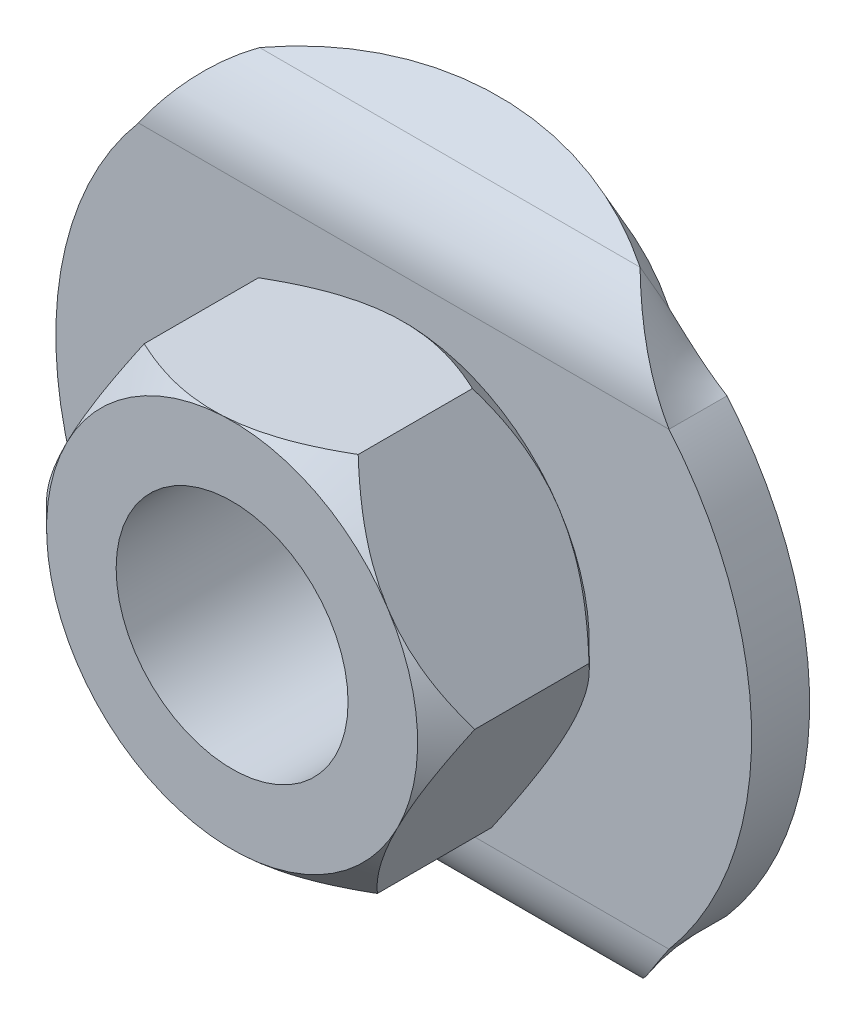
ISO-10303-21;
HEADER;
FILE_DESCRIPTION(('STEP AP214'),'2;1');
FILE_NAME('part.step','',(''),(''),'','','');
FILE_SCHEMA(('AUTOMOTIVE_DESIGN { 1 0 10303 214 1 1 1 1 }'));
ENDSEC;
DATA;
#1=APPLICATION_CONTEXT('core data for automotive mechanical design processes');
#2=APPLICATION_PROTOCOL_DEFINITION('international standard','automotive_design',2000,#1);
#3=PRODUCT_CONTEXT('',#1,'mechanical');
#4=PRODUCT('Part','Part','',(#3));
#5=PRODUCT_RELATED_PRODUCT_CATEGORY('part','',(#4));
#6=PRODUCT_DEFINITION_FORMATION('','',#4);
#7=PRODUCT_DEFINITION_CONTEXT('part definition',#1,'design');
#8=PRODUCT_DEFINITION('design','',#6,#7);
#9=PRODUCT_DEFINITION_SHAPE('','',#8);
#10=(LENGTH_UNIT() NAMED_UNIT(*) SI_UNIT(.MILLI.,.METRE.));
#11=(NAMED_UNIT(*) PLANE_ANGLE_UNIT() SI_UNIT($,.RADIAN.));
#12=(NAMED_UNIT(*) SI_UNIT($,.STERADIAN.) SOLID_ANGLE_UNIT());
#13=UNCERTAINTY_MEASURE_WITH_UNIT(LENGTH_MEASURE(1.E-05),#10,'distance_accuracy_value','');
#14=(GEOMETRIC_REPRESENTATION_CONTEXT(3) GLOBAL_UNCERTAINTY_ASSIGNED_CONTEXT((#13)) GLOBAL_UNIT_ASSIGNED_CONTEXT((#10,
#11,#12)) REPRESENTATION_CONTEXT('',''));
#15=CARTESIAN_POINT('',(0.,0.,0.));
#16=DIRECTION('',(0.,0.,1.));
#17=DIRECTION('',(1.,0.,0.));
#18=AXIS2_PLACEMENT_3D('',#15,#16,#17);
#19=CARTESIAN_POINT('',(0.,-3.43403195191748,5.6943870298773));
#20=DIRECTION('',(0.,0.866025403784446,-0.5));
#21=DIRECTION('',(0.,0.500000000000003,0.86602540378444));
#22=AXIS2_PLACEMENT_3D('',#19,#20,#21);
#23=PLANE('',#22);
#24=CARTESIAN_POINT('',(0.,-3.43403195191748,5.6943870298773));
#25=DIRECTION('',(0.,-0.866025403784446,0.5));
#26=DIRECTION('',(0.,-0.500000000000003,-0.86602540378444));
#27=AXIS2_PLACEMENT_3D('',#24,#25,#26);
#28=CIRCLE('',#27,7.5);
#29=CARTESIAN_POINT('',(4.10187920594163,-6.5734820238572,0.256700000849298));
#30=VERTEX_POINT('',#29);
#31=CARTESIAN_POINT('',(-4.10187920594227,-6.57348202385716,0.256700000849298));
#32=VERTEX_POINT('',#31);
#33=EDGE_CURVE('E383',#30,#32,#28,.F.);
#34=ORIENTED_EDGE('',*,*,#33,.F.);
#35=DIRECTION('',(-1.00000000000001,0.,0.));
#36=VECTOR('',#35,1.);
#37=CARTESIAN_POINT('',(11.5925733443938,-6.57348202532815,0.25670000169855));
#38=LINE('',#37,#36);
#39=EDGE_CURVE('E386',#32,#30,#38,.F.);
#40=ORIENTED_EDGE('',*,*,#39,.F.);
#41=EDGE_LOOP('',(#34,#40));
#42=FACE_BOUND('',#41,.T.);
#43=ADVANCED_FACE('F14',(#42),#23,.F.);
#44=CARTESIAN_POINT('',(0.,3.43403195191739,5.69438702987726));
#45=DIRECTION('',(0.,-0.866025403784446,-0.5));
#46=DIRECTION('',(0.,0.500000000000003,-0.86602540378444));
#47=AXIS2_PLACEMENT_3D('',#44,#45,#46);
#48=PLANE('',#47);
#49=CARTESIAN_POINT('',(0.,3.43403195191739,5.69438702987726));
#50=DIRECTION('',(0.,0.866025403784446,0.5));
#51=DIRECTION('',(0.,-0.500000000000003,0.86602540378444));
#52=AXIS2_PLACEMENT_3D('',#49,#50,#51);
#53=CIRCLE('',#52,7.5);
#54=CARTESIAN_POINT('',(-4.10187920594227,6.57348202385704,0.256700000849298));
#55=VERTEX_POINT('',#54);
#56=CARTESIAN_POINT('',(4.10187920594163,6.57348202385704,0.256700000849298));
#57=VERTEX_POINT('',#56);
#58=EDGE_CURVE('E378',#55,#57,#53,.F.);
#59=ORIENTED_EDGE('',*,*,#58,.F.);
#60=DIRECTION('',(1.00000000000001,0.,0.));
#61=VECTOR('',#60,1.);
#62=CARTESIAN_POINT('',(-11.5925733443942,6.57348202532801,0.25670000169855));
#63=LINE('',#62,#61);
#64=EDGE_CURVE('E615',#57,#55,#63,.F.);
#65=ORIENTED_EDGE('',*,*,#64,.F.);
#66=EDGE_LOOP('',(#59,#65));
#67=FACE_BOUND('',#66,.T.);
#68=ADVANCED_FACE('F898',(#67),#48,.F.);
#69=CARTESIAN_POINT('',(0.,2.35150019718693,5.06938702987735));
#70=DIRECTION('',(0.,0.866025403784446,0.5));
#71=DIRECTION('',(0.,-0.500000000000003,0.86602540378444));
#72=AXIS2_PLACEMENT_3D('',#69,#70,#71);
#73=CYLINDRICAL_SURFACE('',#72,7.5);
#74=DIRECTION('',(0.,0.866025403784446,0.5));
#75=VECTOR('',#74,1.);
#76=CARTESIAN_POINT('',(-4.10187920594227,5.49095026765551,-0.3683));
#77=LINE('',#76,#75);
#78=CARTESIAN_POINT('',(-4.10187920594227,5.49095027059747,-0.368299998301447));
#79=VERTEX_POINT('',#78);
#80=EDGE_CURVE('E382',#79,#55,#77,.T.);
#81=ORIENTED_EDGE('',*,*,#80,.T.);
#82=ORIENTED_EDGE('',*,*,#58,.T.);
#83=DIRECTION('',(0.,-0.866025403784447,-0.5));
#84=VECTOR('',#83,1.);
#85=CARTESIAN_POINT('',(4.10187920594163,6.03221614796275,-0.0557999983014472));
#86=LINE('',#85,#84);
#87=CARTESIAN_POINT('',(4.10187920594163,5.49095027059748,-0.368299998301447));
#88=VERTEX_POINT('',#87);
#89=EDGE_CURVE('E396',#57,#88,#86,.T.);
#90=ORIENTED_EDGE('',*,*,#89,.T.);
#91=CARTESIAN_POINT('',(0.,2.35150020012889,5.06938703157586));
#92=DIRECTION('',(0.,0.866025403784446,0.5));
#93=DIRECTION('',(0.,-0.500000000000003,0.86602540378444));
#94=AXIS2_PLACEMENT_3D('',#91,#92,#93);
#95=CIRCLE('',#94,7.5);
#96=EDGE_CURVE('E398',#79,#88,#95,.F.);
#97=ORIENTED_EDGE('',*,*,#96,.F.);
#98=EDGE_LOOP('',(#81,#82,#90,#97));
#99=FACE_BOUND('',#98,.T.);
#100=ADVANCED_FACE('F890',(#99),#73,.T.);
#101=CARTESIAN_POINT('',(0.,-2.35150019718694,5.06938702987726));
#102=DIRECTION('',(0.,-0.866025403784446,0.5));
#103=DIRECTION('',(0.,-0.500000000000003,-0.86602540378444));
#104=AXIS2_PLACEMENT_3D('',#101,#102,#103);
#105=CYLINDRICAL_SURFACE('',#104,7.5);
#106=DIRECTION('',(0.,-0.866025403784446,0.5));
#107=VECTOR('',#106,1.);
#108=CARTESIAN_POINT('',(4.10187920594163,-5.49095026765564,-0.3683));
#109=LINE('',#108,#107);
#110=CARTESIAN_POINT('',(4.10187920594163,-5.49095027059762,-0.368299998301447));
#111=VERTEX_POINT('',#110);
#112=EDGE_CURVE('E381',#111,#30,#109,.T.);
#113=ORIENTED_EDGE('',*,*,#112,.T.);
#114=ORIENTED_EDGE('',*,*,#33,.T.);
#115=DIRECTION('',(0.,0.866025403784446,-0.5));
#116=VECTOR('',#115,1.);
#117=CARTESIAN_POINT('',(-4.10187920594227,-6.03221614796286,-0.0557999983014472));
#118=LINE('',#117,#116);
#119=CARTESIAN_POINT('',(-4.10187920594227,-5.49095027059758,-0.368299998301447));
#120=VERTEX_POINT('',#119);
#121=EDGE_CURVE('E606',#32,#120,#118,.T.);
#122=ORIENTED_EDGE('',*,*,#121,.T.);
#123=CARTESIAN_POINT('',(0.,-2.3515002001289,5.06938703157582));
#124=DIRECTION('',(0.,-0.866025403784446,0.5));
#125=DIRECTION('',(0.,-0.500000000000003,-0.86602540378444));
#126=AXIS2_PLACEMENT_3D('',#123,#124,#125);
#127=CIRCLE('',#126,7.5);
#128=EDGE_CURVE('E609',#111,#120,#127,.F.);
#129=ORIENTED_EDGE('',*,*,#128,.F.);
#130=EDGE_LOOP('',(#113,#114,#122,#129));
#131=FACE_BOUND('',#130,.T.);
#132=ADVANCED_FACE('F636',(#131),#105,.T.);
#133=CARTESIAN_POINT('',(11.5925733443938,-4.85303595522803,-0.736600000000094));
#134=DIRECTION('',(-1.00000000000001,0.,0.));
#135=DIRECTION('',(0.,1.00000000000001,0.));
#136=AXIS2_PLACEMENT_3D('',#133,#134,#135);
#137=CYLINDRICAL_SURFACE('',#136,1.98660000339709);
#138=ORIENTED_EDGE('',*,*,#39,.T.);
#139=CARTESIAN_POINT('',(4.10187920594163,-6.57348202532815,0.25670000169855));
#140=CARTESIAN_POINT('',(4.1336282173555,-6.55757514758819,0.284262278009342));
#141=CARTESIAN_POINT('',(4.16490700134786,-6.54076858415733,0.311831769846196));
#142=CARTESIAN_POINT('',(4.22667974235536,-6.50540382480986,0.366722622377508));
#143=CARTESIAN_POINT('',(4.25717373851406,-6.48684571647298,0.394043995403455));
#144=CARTESIAN_POINT('',(4.34770669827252,-6.42861954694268,0.47523736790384));
#145=CARTESIAN_POINT('',(4.40680698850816,-6.386394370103,0.528347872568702));
#146=CARTESIAN_POINT('',(4.52318306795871,-6.29543400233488,0.631167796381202));
#147=CARTESIAN_POINT('',(4.58045502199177,-6.24668611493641,0.680870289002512));
#148=CARTESIAN_POINT('',(4.69361861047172,-6.14335270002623,0.775544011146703));
#149=CARTESIAN_POINT('',(4.74951041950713,-6.08876791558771,0.82051584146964));
#150=CARTESIAN_POINT('',(4.86067407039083,-5.97361825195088,0.905362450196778));
#151=CARTESIAN_POINT('',(4.9159315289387,-5.91299216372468,0.945173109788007));
#152=CARTESIAN_POINT('',(5.02554976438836,-5.78711289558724,1.01821678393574));
#153=CARTESIAN_POINT('',(5.07991037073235,-5.72185884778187,1.05144856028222));
#154=CARTESIAN_POINT('',(5.18763623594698,-5.587707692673,1.11061254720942));
#155=CARTESIAN_POINT('',(5.24100403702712,-5.51882237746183,1.13656684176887));
#156=CARTESIAN_POINT('',(5.34695209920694,-5.37809118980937,1.18077592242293));
#157=CARTESIAN_POINT('',(5.39953274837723,-5.30624684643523,1.19903463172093));
#158=CARTESIAN_POINT('',(5.4966266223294,-5.17108909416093,1.22540354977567));
#159=CARTESIAN_POINT('',(5.54121161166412,-5.1080363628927,1.23459627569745));
#160=CARTESIAN_POINT('',(5.63000282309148,-4.98105031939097,1.24689941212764));
#161=CARTESIAN_POINT('',(5.67420893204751,-4.91711675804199,1.25000806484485));
#162=CARTESIAN_POINT('',(5.71822017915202,-4.85303595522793,1.25000000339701));
#163=B_SPLINE_CURVE_WITH_KNOTS('',3,(#139,#140,#141,#142,#143,#144,#145,#146,#147,#148,#149,
#150,#151,#152,#153,#154,#155,#156,#157,#158,#159,#160,#161,#162),.UNSPECIFIED.,.F.,.F.,(4,2,2,
2,2,2,2,2,2,2,2,4),(0.,0.134829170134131,0.269651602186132,0.539252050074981,0.809385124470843,
1.07948385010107,1.35266910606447,1.62590572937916,1.89830399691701,2.1705632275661,
2.40363128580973,2.63676667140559),.UNSPECIFIED.);
#164=CARTESIAN_POINT('',(5.71822017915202,-4.85303595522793,1.25000000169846));
#165=VERTEX_POINT('',#164);
#166=EDGE_CURVE('E605',#30,#165,#163,.T.);
#167=ORIENTED_EDGE('',*,*,#166,.T.);
#168=DIRECTION('',(1.00000000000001,0.,0.));
#169=VECTOR('',#168,1.);
#170=CARTESIAN_POINT('',(0.,-4.853035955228,1.24999999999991));
#171=LINE('',#170,#169);
#172=CARTESIAN_POINT('',(-5.71822017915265,-4.853035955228,1.25000000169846));
#173=VERTEX_POINT('',#172);
#174=EDGE_CURVE('E602',#165,#173,#171,.F.);
#175=ORIENTED_EDGE('',*,*,#174,.T.);
#176=CARTESIAN_POINT('',(-5.71822017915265,-4.853035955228,1.25000000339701));
#177=CARTESIAN_POINT('',(-5.67959663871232,-4.91767073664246,1.24999365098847));
#178=CARTESIAN_POINT('',(-5.63972821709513,-4.98151481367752,1.24684636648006));
#179=CARTESIAN_POINT('',(-5.55796924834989,-5.10723739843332,1.23468169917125));
#180=CARTESIAN_POINT('',(-5.51608075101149,-5.16911779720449,1.22567015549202));
#181=CARTESIAN_POINT('',(-5.43087952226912,-5.2903616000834,1.20224450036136));
#182=CARTESIAN_POINT('',(-5.38757475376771,-5.34973582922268,1.18785701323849));
#183=CARTESIAN_POINT('',(-5.29965748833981,-5.4660454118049,1.15402666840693));
#184=CARTESIAN_POINT('',(-5.25504461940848,-5.5229800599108,1.13458235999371));
#185=CARTESIAN_POINT('',(-5.16370576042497,-5.63560176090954,1.0903976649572));
#186=CARTESIAN_POINT('',(-5.11695486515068,-5.69122079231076,1.06553571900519));
#187=CARTESIAN_POINT('',(-5.0226513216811,-5.79940319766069,1.01115050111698));
#188=CARTESIAN_POINT('',(-4.97509872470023,-5.85196676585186,0.981627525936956));
#189=CARTESIAN_POINT('',(-4.87911559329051,-5.95379600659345,0.918244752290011));
#190=CARTESIAN_POINT('',(-4.83068351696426,-6.00305499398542,0.88437654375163));
#191=CARTESIAN_POINT('',(-4.7331714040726,-6.09791412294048,0.81272086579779));
#192=CARTESIAN_POINT('',(-4.68409139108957,-6.1435143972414,0.774933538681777));
#193=CARTESIAN_POINT('',(-4.54732349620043,-6.26454352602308,0.665221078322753));
#194=CARTESIAN_POINT('',(-4.4590302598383,-6.3358786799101,0.589429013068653));
#195=CARTESIAN_POINT('',(-4.32567646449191,-6.43271326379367,0.469156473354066));
#196=CARTESIAN_POINT('',(-4.2811400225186,-6.46325872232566,0.42803447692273));
#197=CARTESIAN_POINT('',(-4.1917454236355,-6.52094248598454,0.343801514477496));
#198=CARTESIAN_POINT('',(-4.14688727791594,-6.54808090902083,0.300690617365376));
#199=CARTESIAN_POINT('',(-4.10187920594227,-6.57348202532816,0.25670000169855));
#200=B_SPLINE_CURVE_WITH_KNOTS('',3,(#176,#177,#178,#179,#180,#181,#182,#183,#184,#185,#186,
#187,#188,#189,#190,#191,#192,#193,#194,#195,#196,#197,#198,#199),.UNSPECIFIED.,.F.,.F.,(4,2,2,
2,2,2,2,2,2,2,2,4),(0.,0.225749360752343,0.451274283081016,0.675696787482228,0.900183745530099,
1.13035098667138,1.36050357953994,1.59110854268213,1.82170513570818,2.23000545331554,
2.43354895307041,2.63708540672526),.UNSPECIFIED.);
#201=EDGE_CURVE('E427',#173,#32,#200,.T.);
#202=ORIENTED_EDGE('',*,*,#201,.T.);
#203=EDGE_LOOP('',(#138,#167,#175,#202));
#204=FACE_BOUND('',#203,.T.);
#205=ADVANCED_FACE('F411',(#204),#137,.T.);
#206=CARTESIAN_POINT('',(-11.5925733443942,4.85303595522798,-0.7366));
#207=DIRECTION('',(1.00000000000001,0.,0.));
#208=DIRECTION('',(0.,0.,1.));
#209=AXIS2_PLACEMENT_3D('',#206,#207,#208);
#210=CYLINDRICAL_SURFACE('',#209,1.98660000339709);
#211=ORIENTED_EDGE('',*,*,#64,.T.);
#212=CARTESIAN_POINT('',(-4.10187920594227,6.57348202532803,0.25670000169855));
#213=CARTESIAN_POINT('',(-4.13362693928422,6.55757577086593,0.284261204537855));
#214=CARTESIAN_POINT('',(-4.16490433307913,6.5407698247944,0.31182974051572));
#215=CARTESIAN_POINT('',(-4.22667416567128,6.50540633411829,0.366718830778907));
#216=CARTESIAN_POINT('',(-4.25716664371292,6.48684887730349,0.394039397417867));
#217=CARTESIAN_POINT('',(-4.34769499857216,6.42862478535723,0.475230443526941));
#218=CARTESIAN_POINT('',(-4.40679216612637,6.38640115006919,0.528339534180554));
#219=CARTESIAN_POINT('',(-4.52316218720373,6.29544438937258,0.631156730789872));
#220=CARTESIAN_POINT('',(-4.58043120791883,6.24669857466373,0.680857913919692));
#221=CARTESIAN_POINT('',(-4.69358926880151,6.1433698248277,0.775529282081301));
#222=CARTESIAN_POINT('',(-4.7494784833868,6.08878763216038,0.820500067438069));
#223=CARTESIAN_POINT('',(-4.86063834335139,5.97364253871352,0.90534581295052));
#224=CARTESIAN_POINT('',(-4.91589458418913,5.91301832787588,0.945156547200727));
#225=CARTESIAN_POINT('',(-5.02551072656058,5.78714311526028,1.01820062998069));
#226=CARTESIAN_POINT('',(-5.0798704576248,5.7218912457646,1.05143274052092));
#227=CARTESIAN_POINT('',(-5.18759490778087,5.58774461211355,1.11059779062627));
#228=CARTESIAN_POINT('',(-5.24096216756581,5.51886163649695,1.13655280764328));
#229=CARTESIAN_POINT('',(-5.3469094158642,5.37813526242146,1.18076377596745));
#230=CARTESIAN_POINT('',(-5.39948979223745,5.30629339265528,1.1990236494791));
#231=CARTESIAN_POINT('',(-5.49659064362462,5.17113024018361,1.22539714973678));
#232=CARTESIAN_POINT('',(-5.5411827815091,5.10806939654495,1.23459227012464));
#233=CARTESIAN_POINT('',(-5.62998836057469,4.98106692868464,1.24689860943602));
#234=CARTESIAN_POINT('',(-5.67420168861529,4.91712505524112,1.25000806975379));
#235=CARTESIAN_POINT('',(-5.71822017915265,4.85303595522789,1.2500000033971));
#236=B_SPLINE_CURVE_WITH_KNOTS('',3,(#212,#213,#214,#215,#216,#217,#218,#219,#220,#221,#222,
#223,#224,#225,#226,#227,#228,#229,#230,#231,#232,#233,#234,#235),.UNSPECIFIED.,.F.,.F.,(4,2,2,
2,2,2,2,2,2,2,2,4),(0.,0.134823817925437,0.269640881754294,0.539230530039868,0.809352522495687,
1.0794401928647,1.35261961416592,1.62585039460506,1.89824304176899,2.17049668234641,
2.40359752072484,2.63676570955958),.UNSPECIFIED.);
#237=CARTESIAN_POINT('',(-5.71822017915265,4.85303595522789,1.25000000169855));
#238=VERTEX_POINT('',#237);
#239=EDGE_CURVE('E418',#55,#238,#236,.T.);
#240=ORIENTED_EDGE('',*,*,#239,.T.);
#241=DIRECTION('',(1.00000000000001,0.,0.));
#242=VECTOR('',#241,1.);
#243=CARTESIAN_POINT('',(0.,4.85303595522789,1.25));
#244=LINE('',#243,#242);
#245=CARTESIAN_POINT('',(5.71822017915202,4.85303595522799,1.25000000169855));
#246=VERTEX_POINT('',#245);
#247=EDGE_CURVE('E599',#238,#246,#244,.T.);
#248=ORIENTED_EDGE('',*,*,#247,.T.);
#249=CARTESIAN_POINT('',(5.71822017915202,4.85303595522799,1.2500000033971));
#250=CARTESIAN_POINT('',(5.67959599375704,4.91767115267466,1.24999365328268));
#251=CARTESIAN_POINT('',(5.63972700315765,4.98151568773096,1.24684632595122));
#252=CARTESIAN_POINT('',(5.55796699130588,5.10723923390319,1.23468147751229));
#253=CARTESIAN_POINT('',(5.51607801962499,5.1691201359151,1.22566979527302));
#254=CARTESIAN_POINT('',(5.43087588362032,5.29036494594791,1.20224376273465));
#255=CARTESIAN_POINT('',(5.38757068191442,5.34973967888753,1.18785603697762));
#256=CARTESIAN_POINT('',(5.29965256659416,5.46605023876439,1.15402512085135));
#257=CARTESIAN_POINT('',(5.25503928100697,5.52298536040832,1.13458047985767));
#258=CARTESIAN_POINT('',(5.16369962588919,5.6356079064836,1.09039504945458));
#259=CARTESIAN_POINT('',(5.11694835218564,5.69122731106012,1.06553270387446));
#260=CARTESIAN_POINT('',(5.02264404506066,5.79941039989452,1.01114661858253));
#261=CARTESIAN_POINT('',(4.97509106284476,5.85197427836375,0.981623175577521));
#262=CARTESIAN_POINT('',(4.87910715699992,5.95380406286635,0.918239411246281));
#263=CARTESIAN_POINT('',(4.83067469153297,6.00306328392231,0.884370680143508));
#264=CARTESIAN_POINT('',(4.73316179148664,6.09792280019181,0.812713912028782));
#265=CARTESIAN_POINT('',(4.68408138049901,6.14352322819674,0.774926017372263));
#266=CARTESIAN_POINT('',(4.54731478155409,6.26455052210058,0.665213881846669));
#267=CARTESIAN_POINT('',(4.45902327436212,6.335883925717,0.589422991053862));
#268=CARTESIAN_POINT('',(4.32567209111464,6.43271625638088,0.469152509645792));
#269=CARTESIAN_POINT('',(4.28113652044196,6.46326102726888,0.428031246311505));
#270=CARTESIAN_POINT('',(4.19174366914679,6.52094354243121,0.343799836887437));
#271=CARTESIAN_POINT('',(4.14688639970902,6.54808140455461,0.300689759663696));
#272=CARTESIAN_POINT('',(4.10187920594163,6.57348202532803,0.25670000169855));
#273=B_SPLINE_CURVE_WITH_KNOTS('',3,(#249,#250,#251,#252,#253,#254,#255,#256,#257,#258,#259,
#260,#261,#262,#263,#264,#265,#266,#267,#268,#269,#270,#271,#272),.UNSPECIFIED.,.F.,.F.,(4,2,2,
2,2,2,2,2,2,2,2,4),(0.,0.225751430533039,0.45127843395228,0.6757030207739,0.900192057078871,
1.13036118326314,1.36051566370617,1.59112249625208,1.82172095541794,2.230013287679,
2.43355281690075,2.63708530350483),.UNSPECIFIED.);
#274=EDGE_CURVE('E387',#246,#57,#273,.T.);
#275=ORIENTED_EDGE('',*,*,#274,.T.);
#276=EDGE_LOOP('',(#211,#240,#248,#275));
#277=FACE_BOUND('',#276,.T.);
#278=ADVANCED_FACE('F406',(#277),#210,.T.);
#279=CARTESIAN_POINT('',(4.10187920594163,6.58441559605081,0.263012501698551));
#280=CARTESIAN_POINT('',(4.293184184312,6.47576259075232,0.451205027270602));
#281=CARTESIAN_POINT('',(4.47016270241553,6.3420817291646,0.611729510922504));
#282=CARTESIAN_POINT('',(4.79606334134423,6.05214463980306,0.875041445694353));
#283=CARTESIAN_POINT('',(4.9448860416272,5.89602929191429,0.97789807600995));
#284=CARTESIAN_POINT('',(5.34897128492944,5.42691868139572,1.2100154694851));
#285=CARTESIAN_POINT('',(5.56257421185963,5.1152961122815,1.2626250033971));
#286=CARTESIAN_POINT('',(5.71822017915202,4.85303595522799,1.2626250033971));
#287=CARTESIAN_POINT('',(4.10187920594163,6.57348202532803,0.25670000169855));
#288=CARTESIAN_POINT('',(4.2931834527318,6.46551531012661,0.443703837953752));
#289=CARTESIAN_POINT('',(4.47016270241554,6.33267848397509,0.603214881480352));
#290=CARTESIAN_POINT('',(4.79606334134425,6.04457233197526,0.864864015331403));
#291=CARTESIAN_POINT('',(4.9448860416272,5.88944284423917,0.967071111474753));
#292=CARTESIAN_POINT('',(5.34897128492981,5.42329464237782,1.1977226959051));
#293=CARTESIAN_POINT('',(5.56256969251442,5.11364274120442,1.2500000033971));
#294=CARTESIAN_POINT('',(5.71822017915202,4.85303595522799,1.2500000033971));
#295=CARTESIAN_POINT('',(4.10187920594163,5.49095027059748,-0.368299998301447));
#296=CARTESIAN_POINT('',(4.2931110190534,5.45093306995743,-0.298988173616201));
#297=CARTESIAN_POINT('',(4.47016270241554,5.40166410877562,-0.239817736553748));
#298=CARTESIAN_POINT('',(4.79606334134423,5.29483888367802,-0.142802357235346));
#299=CARTESIAN_POINT('',(4.94488604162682,5.23731931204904,-0.104905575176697));
#300=CARTESIAN_POINT('',(5.34897128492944,5.06447889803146,-0.0193835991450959));
#301=CARTESIAN_POINT('',(5.5621222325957,4.94994263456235,3.39710204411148E-09));
#302=CARTESIAN_POINT('',(5.71822017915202,4.85303595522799,3.39710204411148E-09));
#303=CARTESIAN_POINT('',(4.10187920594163,5.48012495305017,-0.37454999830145));
#304=CARTESIAN_POINT('',(4.2931102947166,5.44078724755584,-0.306415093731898));
#305=CARTESIAN_POINT('',(4.4701627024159,5.39235396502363,-0.248248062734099));
#306=CARTESIAN_POINT('',(4.79606334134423,5.28734154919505,-0.152879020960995));
#307=CARTESIAN_POINT('',(4.94488604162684,5.23079807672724,-0.115625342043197));
#308=CARTESIAN_POINT('',(5.34897128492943,5.060890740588,-0.0315546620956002));
#309=CARTESIAN_POINT('',(5.56211775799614,4.94830563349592,-0.0124999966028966));
#310=CARTESIAN_POINT('',(5.71822017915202,4.85303595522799,-0.0124999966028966));
#311=B_SPLINE_SURFACE_WITH_KNOTS('',1,3,((#279,#280,#281,#282,#283,#284,#285,#286),(#287,#288,
#289,#290,#291,#292,#293,#294),(#295,#296,#297,#298,#299,#300,#301,#302),(#303,#304,#305,#306,
#307,#308,#309,#310)),.UNSPECIFIED.,.F.,.F.,.F.,(2,1,1,2),(4,2,2,4),(-0.0101,0.,1.,1.01),(0.,
0.25,0.5,1.),.UNSPECIFIED.);
#312=DIRECTION('',(0.,0.,1.));
#313=VECTOR('',#312,1.);
#314=CARTESIAN_POINT('',(5.71822017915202,4.85303595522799,0.625000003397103));
#315=LINE('',#314,#313);
#316=CARTESIAN_POINT('',(5.71822017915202,4.85303595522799,1.69855102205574E-09));
#317=VERTEX_POINT('',#316);
#318=EDGE_CURVE('E397',#317,#246,#315,.T.);
#319=CARTESIAN_POINT('',(5.71822017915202,4.85303595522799,3.39710204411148E-09));
#320=CARTESIAN_POINT('',(5.69201090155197,4.86929972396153,-4.80857357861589E-06));
#321=CARTESIAN_POINT('',(5.66558963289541,4.88520896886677,-0.000538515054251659));
#322=CARTESIAN_POINT('',(5.61240796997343,4.91636551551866,-0.00256029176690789));
#323=CARTESIAN_POINT('',(5.58564770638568,4.93161306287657,-0.00404800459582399));
#324=CARTESIAN_POINT('',(5.50505142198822,4.97639851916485,-0.00978099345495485));
#325=CARTESIAN_POINT('',(5.45080633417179,5.0050365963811,-0.0152968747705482));
#326=CARTESIAN_POINT('',(5.30355895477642,5.07938532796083,-0.0339757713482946));
#327=CARTESIAN_POINT('',(5.20987781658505,5.12309398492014,-0.0497891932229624));
#328=CARTESIAN_POINT('',(5.0685631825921,5.18464633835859,-0.0784807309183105));
#329=CARTESIAN_POINT('',(5.02126700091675,5.20451749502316,-0.0888891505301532));
#330=CARTESIAN_POINT('',(4.92643826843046,5.24282117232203,-0.111187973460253));
#331=CARTESIAN_POINT('',(4.8789057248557,5.26125373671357,-0.12307833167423));
#332=CARTESIAN_POINT('',(4.77082055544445,5.30143128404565,-0.15155321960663));
#333=CARTESIAN_POINT('',(4.71020864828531,5.32273160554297,-0.168539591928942));
#334=CARTESIAN_POINT('',(4.58874953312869,5.36298356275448,-0.204379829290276));
#335=CARTESIAN_POINT('',(4.52790229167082,5.38193485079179,-0.22323397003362));
#336=CARTESIAN_POINT('',(4.40629364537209,5.41731414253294,-0.262402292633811));
#337=CARTESIAN_POINT('',(4.34553322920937,5.43375381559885,-0.282709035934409));
#338=CARTESIAN_POINT('',(4.22383123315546,5.4641916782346,-0.324606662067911));
#339=CARTESIAN_POINT('',(4.16288962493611,5.47818946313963,-0.346197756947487));
#340=CARTESIAN_POINT('',(4.10187920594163,5.49095027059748,-0.368299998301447));
#341=B_SPLINE_CURVE_WITH_KNOTS('',3,(#319,#320,#321,#322,#323,#324,#325,#326,#327,#328,#329,
#330,#331,#332,#333,#334,#335,#336,#337,#338,#339,#340),.UNSPECIFIED.,.F.,.F.,(4,2,2,2,2,2,2,2,
2,2,4),(0.,0.0925185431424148,0.185002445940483,0.369641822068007,0.682885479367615,
0.839897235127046,0.996904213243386,1.19619127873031,1.39550780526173,1.59386810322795,
1.79226124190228),.UNSPECIFIED.);
#342=EDGE_CURVE('E464',#317,#88,#341,.T.);
#343=ORIENTED_EDGE('',*,*,#274,.F.);
#344=ORIENTED_EDGE('',*,*,#318,.F.);
#345=ORIENTED_EDGE('',*,*,#342,.T.);
#346=ORIENTED_EDGE('',*,*,#89,.F.);
#347=EDGE_LOOP('',(#343,#344,#345,#346));
#348=FACE_BOUND('',#347,.T.);
#349=ADVANCED_FACE('F400',(#348),#311,.F.);
#350=CARTESIAN_POINT('',(0.,2.35150019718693,5.06938702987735));
#351=DIRECTION('',(0.,-0.866025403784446,-0.5));
#352=DIRECTION('',(0.,0.500000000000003,-0.86602540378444));
#353=AXIS2_PLACEMENT_3D('',#350,#351,#352);
#354=PLANE('',#353);
#355=ORIENTED_EDGE('',*,*,#96,.T.);
#356=DIRECTION('',(1.00000000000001,0.,0.));
#357=VECTOR('',#356,1.);
#358=CARTESIAN_POINT('',(-11.5925733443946,5.49095027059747,-0.368299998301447));
#359=LINE('',#358,#357);
#360=EDGE_CURVE('E462',#88,#79,#359,.F.);
#361=ORIENTED_EDGE('',*,*,#360,.T.);
#362=EDGE_LOOP('',(#355,#361));
#363=FACE_BOUND('',#362,.T.);
#364=ADVANCED_FACE('F413',(#363),#354,.T.);
#365=CARTESIAN_POINT('',(-5.71822017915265,4.85303595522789,1.2626250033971));
#366=CARTESIAN_POINT('',(-5.54881177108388,5.10130940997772,1.2626250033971));
#367=CARTESIAN_POINT('',(-5.38841901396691,5.32950460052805,1.21647342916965));
#368=CARTESIAN_POINT('',(-5.08450827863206,5.72713331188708,1.07377896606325));
#369=CARTESIAN_POINT('',(-4.94118305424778,5.89664382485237,0.977524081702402));
#370=CARTESIAN_POINT('',(-4.67179289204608,6.17777889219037,0.770846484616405));
#371=CARTESIAN_POINT('',(-4.54572795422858,6.28972269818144,0.660466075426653));
#372=CARTESIAN_POINT('',(-4.31085836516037,6.46769987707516,0.450296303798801));
#373=CARTESIAN_POINT('',(-4.20199534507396,6.53397564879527,0.350377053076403));
#374=CARTESIAN_POINT('',(-4.10187920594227,6.5844155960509,0.263012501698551));
#375=CARTESIAN_POINT('',(-5.71822017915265,4.85303595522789,1.2500000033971));
#376=CARTESIAN_POINT('',(-5.54881306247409,5.09974088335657,1.2500000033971));
#377=CARTESIAN_POINT('',(-5.38841901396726,5.32649572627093,1.20413987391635));
#378=CARTESIAN_POINT('',(-5.08450827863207,5.72161343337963,1.06234651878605));
#379=CARTESIAN_POINT('',(-4.94118305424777,5.89005349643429,0.966699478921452));
#380=CARTESIAN_POINT('',(-4.67179289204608,6.16941321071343,0.761327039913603));
#381=CARTESIAN_POINT('',(-4.54572795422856,6.28065009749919,0.65164367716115));
#382=CARTESIAN_POINT('',(-4.31085836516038,6.45750335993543,0.442801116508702));
#383=CARTESIAN_POINT('',(-4.20199578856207,6.52336052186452,0.343512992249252));
#384=CARTESIAN_POINT('',(-4.10187920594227,6.57348202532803,0.25670000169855));
#385=CARTESIAN_POINT('',(-5.71822017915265,4.85303595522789,3.39710204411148E-09));
#386=CARTESIAN_POINT('',(-5.54894092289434,4.94444121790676,3.39710204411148E-09));
#387=CARTESIAN_POINT('',(-5.38841901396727,5.0285873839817,-0.0170042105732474));
#388=CARTESIAN_POINT('',(-5.08450827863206,5.17509080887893,-0.0695789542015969));
#389=CARTESIAN_POINT('',(-4.9411830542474,5.23754573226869,-0.10504337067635));
#390=CARTESIAN_POINT('',(-4.67179289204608,5.34112791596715,-0.181192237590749));
#391=CARTESIAN_POINT('',(-4.5457279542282,5.38237280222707,-0.221861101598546));
#392=CARTESIAN_POINT('',(-4.31085836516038,5.44794720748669,-0.299296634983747));
#393=CARTESIAN_POINT('',(-4.20203969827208,5.47235785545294,-0.336096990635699));
#394=CARTESIAN_POINT('',(-4.10187920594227,5.49095027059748,-0.368299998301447));
#395=CARTESIAN_POINT('',(-5.71822017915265,4.85303595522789,-0.0124999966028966));
#396=CARTESIAN_POINT('',(-5.54894220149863,4.94288822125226,-0.0124999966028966));
#397=CARTESIAN_POINT('',(-5.38841901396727,5.02560830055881,-0.0292156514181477));
#398=CARTESIAN_POINT('',(-5.08450827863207,5.16962558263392,-0.0808982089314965));
#399=CARTESIAN_POINT('',(-4.94118305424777,5.23102065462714,-0.115760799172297));
#400=CARTESIAN_POINT('',(-4.67179289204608,5.33284506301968,-0.190617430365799));
#401=CARTESIAN_POINT('',(-4.5457279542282,5.37339002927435,-0.230596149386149));
#402=CARTESIAN_POINT('',(-4.31085836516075,5.4378516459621,-0.306717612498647));
#403=CARTESIAN_POINT('',(-4.20204013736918,5.46184782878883,-0.342893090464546));
#404=CARTESIAN_POINT('',(-4.10187920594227,5.48012495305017,-0.37454999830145));
#405=B_SPLINE_SURFACE_WITH_KNOTS('',1,3,((#365,#366,#367,#368,#369,#370,#371,#372,#373,#374),
(#375,#376,#377,#378,#379,#380,#381,#382,#383,#384),(#385,#386,#387,#388,#389,#390,#391,#392,
#393,#394),(#395,#396,#397,#398,#399,#400,#401,#402,#403,#404)),.UNSPECIFIED.,.F.,.F.,.F.,(2,1,
1,2),(4,2,2,2,4),(-0.0101,0.,1.,1.01),(0.,0.25,0.5,0.75,1.),.UNSPECIFIED.);
#406=CARTESIAN_POINT('',(-4.10187920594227,5.49095027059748,-0.368299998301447));
#407=CARTESIAN_POINT('',(-4.12883157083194,5.48594671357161,-0.359630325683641));
#408=CARTESIAN_POINT('',(-4.15569832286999,5.48065055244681,-0.350868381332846));
#409=CARTESIAN_POINT('',(-4.20928084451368,5.46947698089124,-0.333253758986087));
#410=CARTESIAN_POINT('',(-4.23599661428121,5.46359957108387,-0.324401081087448));
#411=CARTESIAN_POINT('',(-4.31595157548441,5.44510053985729,-0.297846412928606));
#412=CARTESIAN_POINT('',(-4.36899470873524,5.43161280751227,-0.280149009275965));
#413=CARTESIAN_POINT('',(-4.47463213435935,5.40231316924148,-0.245283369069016));
#414=CARTESIAN_POINT('',(-4.52722625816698,5.38650042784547,-0.228115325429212));
#415=CARTESIAN_POINT('',(-4.63204598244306,5.35268943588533,-0.194853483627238));
#416=CARTESIAN_POINT('',(-4.6842716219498,5.33469142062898,-0.178759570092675));
#417=CARTESIAN_POINT('',(-4.77742299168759,5.30062456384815,-0.151264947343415));
#418=CARTESIAN_POINT('',(-4.81841144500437,5.28494806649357,-0.139589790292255));
#419=CARTESIAN_POINT('',(-4.90019379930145,5.25236929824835,-0.117325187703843));
#420=CARTESIAN_POINT('',(-4.94098770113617,5.23546703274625,-0.106735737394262));
#421=CARTESIAN_POINT('',(-5.06307913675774,5.18316822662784,-0.0769006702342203));
#422=CARTESIAN_POINT('',(-5.14416468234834,5.14615051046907,-0.059564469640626));
#423=CARTESIAN_POINT('',(-5.307589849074,5.06771260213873,-0.0307158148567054));
#424=CARTESIAN_POINT('',(-5.38991590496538,5.02621126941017,-0.0193451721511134));
#425=CARTESIAN_POINT('',(-5.51315734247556,4.96230640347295,-0.00782517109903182));
#426=CARTESIAN_POINT('',(-5.55424398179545,4.94070332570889,-0.00490767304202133));
#427=CARTESIAN_POINT('',(-5.63631134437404,4.89711576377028,-0.000995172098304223));
#428=CARTESIAN_POINT('',(-5.67729205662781,4.87513124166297,-3.61531842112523E-07));
#429=CARTESIAN_POINT('',(-5.71822017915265,4.85303595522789,3.39710204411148E-09));
#430=B_SPLINE_CURVE_WITH_KNOTS('',3,(#406,#407,#408,#409,#410,#411,#412,#413,#414,#415,#416,
#417,#418,#419,#420,#421,#422,#423,#424,#425,#426,#427,#428,#429),.UNSPECIFIED.,.F.,.F.,(4,2,2,
2,2,2,2,2,2,2,2,4),(0.,0.086249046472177,0.172498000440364,0.345007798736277,0.517579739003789,
0.690133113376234,0.826335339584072,0.962536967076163,1.23468021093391,1.51302906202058,
1.65252694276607,1.79203877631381),.UNSPECIFIED.);
#431=CARTESIAN_POINT('',(-5.71822017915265,4.85303595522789,1.69855102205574E-09));
#432=VERTEX_POINT('',#431);
#433=EDGE_CURVE('E452',#79,#432,#430,.T.);
#434=DIRECTION('',(0.,0.,-1.));
#435=VECTOR('',#434,1.);
#436=CARTESIAN_POINT('',(-5.71822017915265,4.85303595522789,0.625000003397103));
#437=LINE('',#436,#435);
#438=EDGE_CURVE('E426',#238,#432,#437,.T.);
#439=ORIENTED_EDGE('',*,*,#80,.F.);
#440=ORIENTED_EDGE('',*,*,#433,.T.);
#441=ORIENTED_EDGE('',*,*,#438,.F.);
#442=ORIENTED_EDGE('',*,*,#239,.F.);
#443=EDGE_LOOP('',(#439,#440,#441,#442));
#444=FACE_BOUND('',#443,.T.);
#445=ADVANCED_FACE('F434',(#444),#405,.F.);
#446=CARTESIAN_POINT('',(-4.10187920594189,-6.58441559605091,0.263012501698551));
#447=CARTESIAN_POINT('',(-4.29318671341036,-6.4757611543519,0.451207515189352));
#448=CARTESIAN_POINT('',(-4.47016711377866,-6.34207844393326,0.611733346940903));
#449=CARTESIAN_POINT('',(-4.79607027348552,-6.05213838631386,0.875046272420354));
#450=CARTESIAN_POINT('',(-4.94489360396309,-5.89602192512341,0.977902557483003));
#451=CARTESIAN_POINT('',(-5.34897884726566,-5.42691031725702,1.21001793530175));
#452=CARTESIAN_POINT('',(-5.56257929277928,-5.1152903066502,1.2626250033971));
#453=CARTESIAN_POINT('',(-5.71822017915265,-4.853035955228,1.26262500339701));
#454=CARTESIAN_POINT('',(-4.10187920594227,-6.57348202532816,0.25670000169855));
#455=CARTESIAN_POINT('',(-4.29318598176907,-6.46551388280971,0.44370631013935));
#456=CARTESIAN_POINT('',(-4.47016711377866,-6.33267521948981,0.603218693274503));
#457=CARTESIAN_POINT('',(-4.79607027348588,-6.04456611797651,0.864868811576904));
#458=CARTESIAN_POINT('',(-4.94489360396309,-5.8894355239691,0.967075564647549));
#459=CARTESIAN_POINT('',(-5.3489788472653,-5.42328633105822,1.1977251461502));
#460=CARTESIAN_POINT('',(-5.56257477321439,-5.1136369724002,1.2500000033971));
#461=CARTESIAN_POINT('',(-5.71822017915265,-4.853035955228,1.25000000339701));
#462=CARTESIAN_POINT('',(-4.10187920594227,-5.49095027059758,-0.368299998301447));
#463=CARTESIAN_POINT('',(-4.29311354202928,-5.45093254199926,-0.298987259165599));
#464=CARTESIAN_POINT('',(-4.47016711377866,-5.40166289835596,-0.239816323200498));
#465=CARTESIAN_POINT('',(-4.79607027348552,-5.29483657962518,-0.142800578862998));
#466=CARTESIAN_POINT('',(-4.94489360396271,-5.23731659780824,-0.104903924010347));
#467=CARTESIAN_POINT('',(-5.34897884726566,-5.06447581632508,-0.0193826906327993));
#468=CARTESIAN_POINT('',(-5.56212729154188,-4.94994051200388,3.39710204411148E-09));
#469=CARTESIAN_POINT('',(-5.71822017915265,-4.853035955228,3.39700836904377E-09));
#470=CARTESIAN_POINT('',(-4.10187920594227,-5.48012495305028,-0.37454999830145));
#471=CARTESIAN_POINT('',(-4.29311281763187,-5.4407867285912,-0.306414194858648));
#472=CARTESIAN_POINT('',(-4.4701671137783,-5.39235277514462,-0.248246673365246));
#473=CARTESIAN_POINT('',(-4.79607027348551,-5.28733928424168,-0.152877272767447));
#474=CARTESIAN_POINT('',(-4.94489360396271,-5.2307954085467,-0.115623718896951));
#475=CARTESIAN_POINT('',(-5.3489788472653,-5.06088771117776,-0.031553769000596));
#476=CARTESIAN_POINT('',(-5.56212281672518,-4.94830354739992,-0.0124999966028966));
#477=CARTESIAN_POINT('',(-5.71822017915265,-4.853035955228,-0.0124999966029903));
#478=B_SPLINE_SURFACE_WITH_KNOTS('',1,3,((#446,#447,#448,#449,#450,#451,#452,#453),(#454,#455,
#456,#457,#458,#459,#460,#461),(#462,#463,#464,#465,#466,#467,#468,#469),(#470,#471,#472,#473,
#474,#475,#476,#477)),.UNSPECIFIED.,.F.,.F.,.F.,(2,1,1,2),(4,2,2,4),(-0.0101,0.,1.,1.01),(0.,
0.25,0.5,1.),.UNSPECIFIED.);
#479=DIRECTION('',(0.,0.,1.));
#480=VECTOR('',#479,1.);
#481=CARTESIAN_POINT('',(-5.71822017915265,-4.853035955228,0.625000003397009));
#482=LINE('',#481,#480);
#483=CARTESIAN_POINT('',(-5.71822017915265,-4.853035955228,1.69845734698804E-09));
#484=VERTEX_POINT('',#483);
#485=EDGE_CURVE('E425',#484,#173,#482,.T.);
#486=CARTESIAN_POINT('',(-5.71822017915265,-4.853035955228,3.39700836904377E-09));
#487=CARTESIAN_POINT('',(-5.69201096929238,-4.86929985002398,-4.80948399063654E-06));
#488=CARTESIAN_POINT('',(-5.66558974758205,-4.88520918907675,-0.00053852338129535));
#489=CARTESIAN_POINT('',(-5.61240815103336,-4.91636587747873,-0.00256032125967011));
#490=CARTESIAN_POINT('',(-5.58564790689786,-4.93161347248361,-0.00404804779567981));
#491=CARTESIAN_POINT('',(-5.50505166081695,-4.97639902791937,-0.00978107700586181));
#492=CARTESIAN_POINT('',(-5.45080656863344,-5.00503711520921,-0.0152969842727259));
#493=CARTESIAN_POINT('',(-5.30355906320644,-5.07938587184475,-0.0339759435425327));
#494=CARTESIAN_POINT('',(-5.20987778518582,-5.12309450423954,-0.0497893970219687));
#495=CARTESIAN_POINT('',(-5.06856294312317,-5.18464682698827,-0.0784809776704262));
#496=CARTESIAN_POINT('',(-5.02126669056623,-5.20451797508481,-0.0888894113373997));
#497=CARTESIAN_POINT('',(-4.92643781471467,-5.24282163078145,-0.111188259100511));
#498=CARTESIAN_POINT('',(-4.87890519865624,-5.26125418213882,-0.123078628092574));
#499=CARTESIAN_POINT('',(-4.77081999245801,-5.30143165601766,-0.151553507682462));
#500=CARTESIAN_POINT('',(-4.71020812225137,-5.32273192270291,-0.168539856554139));
#501=CARTESIAN_POINT('',(-4.58874908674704,-5.36298378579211,-0.204380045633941));
#502=CARTESIAN_POINT('',(-4.52790188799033,-5.38193503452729,-0.22323416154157));
#503=CARTESIAN_POINT('',(-4.40629334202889,-5.41731425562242,-0.262402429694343));
#504=CARTESIAN_POINT('',(-4.34553298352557,-5.43375389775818,-0.282709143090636));
#505=CARTESIAN_POINT('',(-4.22383110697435,-5.46419171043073,-0.324606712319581));
#506=CARTESIAN_POINT('',(-4.16288956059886,-5.47818947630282,-0.346197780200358));
#507=CARTESIAN_POINT('',(-4.10187920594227,-5.49095027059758,-0.368299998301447));
#508=B_SPLINE_CURVE_WITH_KNOTS('',3,(#486,#487,#488,#489,#490,#491,#492,#493,#494,#495,#496,
#497,#498,#499,#500,#501,#502,#503,#504,#505,#506,#507),.UNSPECIFIED.,.F.,.F.,(4,2,2,2,2,2,2,2,
2,2,4),(0.,0.0925185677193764,0.185002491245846,0.369641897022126,0.682885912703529,
0.839897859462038,0.996905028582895,1.19619192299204,1.39550827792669,1.59386836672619,
1.79226129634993),.UNSPECIFIED.);
#509=EDGE_CURVE('E538',#484,#120,#508,.T.);
#510=ORIENTED_EDGE('',*,*,#201,.F.);
#511=ORIENTED_EDGE('',*,*,#485,.F.);
#512=ORIENTED_EDGE('',*,*,#509,.T.);
#513=ORIENTED_EDGE('',*,*,#121,.F.);
#514=EDGE_LOOP('',(#510,#511,#512,#513));
#515=FACE_BOUND('',#514,.T.);
#516=ADVANCED_FACE('F439',(#515),#478,.F.);
#517=CARTESIAN_POINT('',(0.,-2.35150019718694,5.06938702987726));
#518=DIRECTION('',(0.,0.866025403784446,-0.5));
#519=DIRECTION('',(0.,0.500000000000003,0.86602540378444));
#520=AXIS2_PLACEMENT_3D('',#517,#518,#519);
#521=PLANE('',#520);
#522=ORIENTED_EDGE('',*,*,#128,.T.);
#523=DIRECTION('',(-1.00000000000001,0.,0.));
#524=VECTOR('',#523,1.);
#525=CARTESIAN_POINT('',(11.5925733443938,-5.49095027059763,-0.368299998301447));
#526=LINE('',#525,#524);
#527=EDGE_CURVE('E537',#120,#111,#526,.F.);
#528=ORIENTED_EDGE('',*,*,#527,.T.);
#529=EDGE_LOOP('',(#522,#528));
#530=FACE_BOUND('',#529,.T.);
#531=ADVANCED_FACE('F481',(#530),#521,.T.);
#532=CARTESIAN_POINT('',(5.71822017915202,-4.85303595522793,1.26262500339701));
#533=CARTESIAN_POINT('',(5.54883077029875,-5.10129024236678,1.2626250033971));
#534=CARTESIAN_POINT('',(5.3884521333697,-5.329471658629,1.21648043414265));
#535=CARTESIAN_POINT('',(5.08456032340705,-5.72708548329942,1.073800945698));
#536=CARTESIAN_POINT('',(4.94123983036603,-5.89659477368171,0.977553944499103));
#537=CARTESIAN_POINT('',(4.67184966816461,-6.17773575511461,0.770884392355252));
#538=CARTESIAN_POINT('',(4.54577999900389,-6.28968655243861,0.660504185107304));
#539=CARTESIAN_POINT('',(4.31089148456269,-6.46768056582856,0.450323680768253));
#540=CARTESIAN_POINT('',(4.20201427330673,-6.53396611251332,0.350393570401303));
#541=CARTESIAN_POINT('',(4.10187920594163,-6.58441559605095,0.263012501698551));
#542=CARTESIAN_POINT('',(5.71822017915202,-4.85303595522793,1.25000000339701));
#543=CARTESIAN_POINT('',(5.54883206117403,-5.09972183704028,1.2500000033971));
#544=CARTESIAN_POINT('',(5.38845213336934,-5.32646299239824,1.2041468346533));
#545=CARTESIAN_POINT('',(5.08456032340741,-5.72156590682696,1.0623683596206));
#546=CARTESIAN_POINT('',(4.94123983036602,-5.89000475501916,0.966729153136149));
#547=CARTESIAN_POINT('',(4.67184966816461,-6.16937034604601,0.761364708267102));
#548=CARTESIAN_POINT('',(4.54577999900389,-6.28061418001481,0.651681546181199));
#549=CARTESIAN_POINT('',(4.31089148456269,-6.45748417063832,0.442828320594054));
#550=CARTESIAN_POINT('',(4.20201471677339,-6.52335104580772,0.343529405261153));
#551=CARTESIAN_POINT('',(4.10187920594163,-6.57348202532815,0.25670000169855));
#552=CARTESIAN_POINT('',(5.71822017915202,-4.85303595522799,3.39700836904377E-09));
#553=CARTESIAN_POINT('',(5.5489598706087,-4.94443418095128,3.39710204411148E-09));
#554=CARTESIAN_POINT('',(5.38845213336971,-5.02857524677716,-0.0170016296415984));
#555=CARTESIAN_POINT('',(5.08456032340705,-5.17507318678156,-0.0695708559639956));
#556=CARTESIAN_POINT('',(4.94123983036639,-5.23752765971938,-0.105032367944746));
#557=CARTESIAN_POINT('',(4.67184966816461,-5.34111202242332,-0.181178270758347));
#558=CARTESIAN_POINT('',(4.54577999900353,-5.38235948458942,-0.22184706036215));
#559=CARTESIAN_POINT('',(4.31089148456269,-5.4479400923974,-0.299286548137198));
#560=CARTESIAN_POINT('',(4.20205862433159,-5.4723543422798,-0.336090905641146));
#561=CARTESIAN_POINT('',(4.10187920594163,-5.49095027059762,-0.368299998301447));
#562=CARTESIAN_POINT('',(5.71822017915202,-4.85303595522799,-0.0124999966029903));
#563=CARTESIAN_POINT('',(5.54896114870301,-4.9428813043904,-0.0124999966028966));
#564=CARTESIAN_POINT('',(5.38845213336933,-5.02559636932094,-0.0292131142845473));
#565=CARTESIAN_POINT('',(5.08456032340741,-5.16960825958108,-0.0808902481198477));
#566=CARTESIAN_POINT('',(4.94123983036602,-5.23100288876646,-0.115749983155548));
#567=CARTESIAN_POINT('',(4.67184966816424,-5.33282943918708,-0.190603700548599));
#568=CARTESIAN_POINT('',(4.54577999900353,-5.37337693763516,-0.230582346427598));
#569=CARTESIAN_POINT('',(4.31089148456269,-5.437844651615,-0.306707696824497));
#570=CARTESIAN_POINT('',(4.20205906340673,-5.46184437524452,-0.342887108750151));
#571=CARTESIAN_POINT('',(4.10187920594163,-5.48012495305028,-0.37454999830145));
#572=B_SPLINE_SURFACE_WITH_KNOTS('',1,3,((#532,#533,#534,#535,#536,#537,#538,#539,#540,#541),
(#542,#543,#544,#545,#546,#547,#548,#549,#550,#551),(#552,#553,#554,#555,#556,#557,#558,#559,
#560,#561),(#562,#563,#564,#565,#566,#567,#568,#569,#570,#571)),.UNSPECIFIED.,.F.,.F.,.F.,(2,1,
1,2),(4,2,2,2,4),(-0.0101,0.,1.,1.01),(0.,0.25,0.5,0.75,1.),.UNSPECIFIED.);
#573=CARTESIAN_POINT('',(4.10187920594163,-5.49095027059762,-0.368299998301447));
#574=CARTESIAN_POINT('',(4.12883258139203,-5.48594652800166,-0.359630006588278));
#575=CARTESIAN_POINT('',(4.15570036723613,-5.48065020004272,-0.350867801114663));
#576=CARTESIAN_POINT('',(4.20928498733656,-5.46947631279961,-0.333252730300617));
#577=CARTESIAN_POINT('',(4.23600182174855,-5.46359875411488,-0.324399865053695));
#578=CARTESIAN_POINT('',(4.31596000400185,-5.44509927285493,-0.297844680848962));
#579=CARTESIAN_POINT('',(4.36900531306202,-5.43161123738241,-0.280146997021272));
#580=CARTESIAN_POINT('',(4.47464709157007,-5.40231088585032,-0.245280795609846));
#581=CARTESIAN_POINT('',(4.52724339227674,-5.38649773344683,-0.228112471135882));
#582=CARTESIAN_POINT('',(4.63206739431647,-5.35268572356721,-0.19485003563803));
#583=CARTESIAN_POINT('',(4.68429513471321,-5.33468710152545,-0.178755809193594));
#584=CARTESIAN_POINT('',(4.77744768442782,-5.30061989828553,-0.151261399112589));
#585=CARTESIAN_POINT('',(4.81843524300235,-5.2849437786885,-0.139586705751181));
#586=CARTESIAN_POINT('',(4.90021576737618,-5.25236575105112,-0.117322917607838));
#587=CARTESIAN_POINT('',(4.94100873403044,-5.23546384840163,-0.106733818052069));
#588=CARTESIAN_POINT('',(5.06309728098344,-5.1831660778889,-0.0768996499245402));
#589=CARTESIAN_POINT('',(5.14418080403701,-5.14614897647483,-0.0595638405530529));
#590=CARTESIAN_POINT('',(5.30760172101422,-5.0677120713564,-0.0307156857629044));
#591=CARTESIAN_POINT('',(5.38992554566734,-5.02621112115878,-0.0193451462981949));
#592=CARTESIAN_POINT('',(5.51316347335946,-4.96230652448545,-0.00782519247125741));
#593=CARTESIAN_POINT('',(5.55424891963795,-4.94070348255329,-0.00490769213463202));
#594=CARTESIAN_POINT('',(5.63631384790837,-4.89711590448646,-0.000995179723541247));
#595=CARTESIAN_POINT('',(5.67729331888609,-4.87513133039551,-3.60043765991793E-07));
#596=CARTESIAN_POINT('',(5.71822017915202,-4.85303595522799,3.39700836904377E-09));
#597=B_SPLINE_CURVE_WITH_KNOTS('',3,(#573,#574,#575,#576,#577,#578,#579,#580,#581,#582,#583,
#584,#585,#586,#587,#588,#589,#590,#591,#592,#593,#594,#595,#596),.UNSPECIFIED.,.F.,.F.,(4,2,2,
2,2,2,2,2,2,2,2,4),(0.,0.0862522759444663,0.172504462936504,0.345020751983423,0.517599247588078,
0.690159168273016,0.826358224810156,0.962556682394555,1.23469354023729,1.51303590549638,
1.65253057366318,1.7920391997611),.UNSPECIFIED.);
#598=CARTESIAN_POINT('',(5.71822017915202,-4.853035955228,1.69845734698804E-09));
#599=VERTEX_POINT('',#598);
#600=EDGE_CURVE('E531',#111,#599,#597,.T.);
#601=DIRECTION('',(0.,0.,1.));
#602=VECTOR('',#601,1.);
#603=CARTESIAN_POINT('',(5.71822017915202,-4.853035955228,0.));
#604=LINE('',#603,#602);
#605=EDGE_CURVE('E594',#165,#599,#604,.F.);
#606=ORIENTED_EDGE('',*,*,#112,.F.);
#607=ORIENTED_EDGE('',*,*,#600,.T.);
#608=ORIENTED_EDGE('',*,*,#605,.F.);
#609=ORIENTED_EDGE('',*,*,#166,.F.);
#610=EDGE_LOOP('',(#606,#607,#608,#609));
#611=FACE_BOUND('',#610,.T.);
#612=ADVANCED_FACE('F480',(#611),#572,.F.);
#613=CARTESIAN_POINT('',(0.,0.,1.25));
#614=DIRECTION('',(0.,0.,-1.));
#615=DIRECTION('',(1.00000000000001,0.,0.));
#616=AXIS2_PLACEMENT_3D('',#613,#614,#615);
#617=PLANE('',#616);
#618=CARTESIAN_POINT('',(0.,0.,1.25));
#619=DIRECTION('',(0.,0.,-1.));
#620=DIRECTION('',(0.,1.00000000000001,0.));
#621=AXIS2_PLACEMENT_3D('',#618,#619,#620);
#622=CIRCLE('',#621,3.99999999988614);
#623=CARTESIAN_POINT('',(0.206852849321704,-3.99464790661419,1.24999999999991));
#624=VERTEX_POINT('',#623);
#625=CARTESIAN_POINT('',(-3.35604014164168,-2.17646377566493,1.25));
#626=VERTEX_POINT('',#625);
#627=EDGE_CURVE('E374',#624,#626,#622,.T.);
#628=ORIENTED_EDGE('',*,*,#627,.T.);
#629=CARTESIAN_POINT('',(0.,0.,1.25));
#630=DIRECTION('',(0.,0.,-1.));
#631=DIRECTION('',(0.,1.00000000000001,0.));
#632=AXIS2_PLACEMENT_3D('',#629,#630,#631);
#633=CIRCLE('',#632,3.99999999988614);
#634=CARTESIAN_POINT('',(-3.562892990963,1.81818413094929,1.24999999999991));
#635=VERTEX_POINT('',#634);
#636=EDGE_CURVE('E9',#626,#635,#633,.T.);
#637=ORIENTED_EDGE('',*,*,#636,.T.);
#638=CARTESIAN_POINT('',(0.,0.,1.25));
#639=DIRECTION('',(0.,0.,-1.));
#640=DIRECTION('',(0.,1.00000000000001,0.));
#641=AXIS2_PLACEMENT_3D('',#638,#639,#640);
#642=CIRCLE('',#641,3.99999999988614);
#643=CARTESIAN_POINT('',(-0.206852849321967,3.99464790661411,1.25));
#644=VERTEX_POINT('',#643);
#645=EDGE_CURVE('E25',#635,#644,#642,.T.);
#646=ORIENTED_EDGE('',*,*,#645,.T.);
#647=CARTESIAN_POINT('',(0.,0.,1.25));
#648=DIRECTION('',(0.,0.,-1.));
#649=DIRECTION('',(0.,1.00000000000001,0.));
#650=AXIS2_PLACEMENT_3D('',#647,#648,#649);
#651=CIRCLE('',#650,3.99999999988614);
#652=CARTESIAN_POINT('',(3.3560401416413,2.1764637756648,1.24999999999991));
#653=VERTEX_POINT('',#652);
#654=EDGE_CURVE('E335',#644,#653,#651,.T.);
#655=ORIENTED_EDGE('',*,*,#654,.T.);
#656=CARTESIAN_POINT('',(0.,0.,1.25));
#657=DIRECTION('',(0.,0.,-1.));
#658=DIRECTION('',(0.,1.00000000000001,0.));
#659=AXIS2_PLACEMENT_3D('',#656,#657,#658);
#660=CIRCLE('',#659,3.99999999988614);
#661=CARTESIAN_POINT('',(3.56289299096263,-1.81818413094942,1.25));
#662=VERTEX_POINT('',#661);
#663=EDGE_CURVE('E339',#653,#662,#660,.T.);
#664=ORIENTED_EDGE('',*,*,#663,.T.);
#665=CARTESIAN_POINT('',(0.,0.,1.25));
#666=DIRECTION('',(0.,0.,-1.));
#667=DIRECTION('',(0.,1.00000000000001,0.));
#668=AXIS2_PLACEMENT_3D('',#665,#666,#667);
#669=CIRCLE('',#668,3.99999999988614);
#670=EDGE_CURVE('E342',#662,#624,#669,.T.);
#671=ORIENTED_EDGE('',*,*,#670,.T.);
#672=EDGE_LOOP('',(#628,#637,#646,#655,#664,#671));
#673=FACE_BOUND('',#672,.T.);
#674=ORIENTED_EDGE('',*,*,#247,.F.);
#675=CARTESIAN_POINT('',(0.,0.,1.25));
#676=DIRECTION('',(0.,0.,1.));
#677=DIRECTION('',(-1.00000000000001,0.,0.));
#678=AXIS2_PLACEMENT_3D('',#675,#676,#677);
#679=CIRCLE('',#678,7.5);
#680=EDGE_CURVE('E528',#173,#238,#679,.F.);
#681=ORIENTED_EDGE('',*,*,#680,.F.);
#682=ORIENTED_EDGE('',*,*,#174,.F.);
#683=CARTESIAN_POINT('',(0.,0.,1.25));
#684=DIRECTION('',(0.,0.,1.));
#685=DIRECTION('',(-1.00000000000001,0.,0.));
#686=AXIS2_PLACEMENT_3D('',#683,#684,#685);
#687=CIRCLE('',#686,7.5);
#688=EDGE_CURVE('E461',#246,#165,#687,.F.);
#689=ORIENTED_EDGE('',*,*,#688,.F.);
#690=EDGE_LOOP('',(#674,#681,#682,#689));
#691=FACE_BOUND('',#690,.T.);
#692=ADVANCED_FACE('F364',(#673,#691),#617,.F.);
#693=CARTESIAN_POINT('',(-11.5925733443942,4.85303595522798,-0.7366));
#694=DIRECTION('',(1.00000000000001,0.,0.));
#695=DIRECTION('',(0.,0.,1.));
#696=AXIS2_PLACEMENT_3D('',#693,#694,#695);
#697=CYLINDRICAL_SURFACE('',#696,0.736600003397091);
#698=ORIENTED_EDGE('',*,*,#433,.F.);
#699=ORIENTED_EDGE('',*,*,#360,.F.);
#700=ORIENTED_EDGE('',*,*,#342,.F.);
#701=DIRECTION('',(1.00000000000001,0.,0.));
#702=VECTOR('',#701,1.);
#703=CARTESIAN_POINT('',(0.,4.85303595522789,0.));
#704=LINE('',#703,#702);
#705=EDGE_CURVE('E527',#432,#317,#704,.T.);
#706=ORIENTED_EDGE('',*,*,#705,.F.);
#707=EDGE_LOOP('',(#698,#699,#700,#706));
#708=FACE_BOUND('',#707,.T.);
#709=ADVANCED_FACE('F470',(#708),#697,.F.);
#710=CARTESIAN_POINT('',(0.,0.,0.));
#711=DIRECTION('',(0.,0.,1.));
#712=DIRECTION('',(-1.00000000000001,0.,0.));
#713=AXIS2_PLACEMENT_3D('',#710,#711,#712);
#714=CYLINDRICAL_SURFACE('',#713,7.5);
#715=ORIENTED_EDGE('',*,*,#688,.T.);
#716=ORIENTED_EDGE('',*,*,#605,.T.);
#717=CARTESIAN_POINT('',(0.,0.,3.39710204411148E-09));
#718=DIRECTION('',(0.,0.,1.));
#719=DIRECTION('',(-1.00000000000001,0.,0.));
#720=AXIS2_PLACEMENT_3D('',#717,#718,#719);
#721=CIRCLE('',#720,7.5);
#722=EDGE_CURVE('E524',#317,#599,#721,.F.);
#723=ORIENTED_EDGE('',*,*,#722,.F.);
#724=ORIENTED_EDGE('',*,*,#318,.T.);
#725=EDGE_LOOP('',(#715,#716,#723,#724));
#726=FACE_BOUND('',#725,.T.);
#727=ADVANCED_FACE('F475',(#726),#714,.T.);
#728=CARTESIAN_POINT('',(11.5925733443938,-4.85303595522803,-0.736600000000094));
#729=DIRECTION('',(-1.00000000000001,0.,0.));
#730=DIRECTION('',(0.,1.00000000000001,0.));
#731=AXIS2_PLACEMENT_3D('',#728,#729,#730);
#732=CYLINDRICAL_SURFACE('',#731,0.736600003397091);
#733=ORIENTED_EDGE('',*,*,#600,.F.);
#734=ORIENTED_EDGE('',*,*,#527,.F.);
#735=ORIENTED_EDGE('',*,*,#509,.F.);
#736=DIRECTION('',(1.00000000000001,0.,0.));
#737=VECTOR('',#736,1.);
#738=CARTESIAN_POINT('',(0.,-4.853035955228,0.));
#739=LINE('',#738,#737);
#740=EDGE_CURVE('E523',#599,#484,#739,.F.);
#741=ORIENTED_EDGE('',*,*,#740,.F.);
#742=EDGE_LOOP('',(#733,#734,#735,#741));
#743=FACE_BOUND('',#742,.T.);
#744=ADVANCED_FACE('F543',(#743),#732,.F.);
#745=CARTESIAN_POINT('',(0.,0.,0.));
#746=DIRECTION('',(0.,0.,1.));
#747=DIRECTION('',(-1.00000000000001,0.,0.));
#748=AXIS2_PLACEMENT_3D('',#745,#746,#747);
#749=CYLINDRICAL_SURFACE('',#748,7.5);
#750=ORIENTED_EDGE('',*,*,#680,.T.);
#751=ORIENTED_EDGE('',*,*,#438,.T.);
#752=CARTESIAN_POINT('',(0.,0.,0.));
#753=DIRECTION('',(0.,0.,1.));
#754=DIRECTION('',(-1.00000000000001,0.,0.));
#755=AXIS2_PLACEMENT_3D('',#752,#753,#754);
#756=CIRCLE('',#755,7.5);
#757=EDGE_CURVE('E520',#484,#432,#756,.F.);
#758=ORIENTED_EDGE('',*,*,#757,.F.);
#759=ORIENTED_EDGE('',*,*,#485,.T.);
#760=EDGE_LOOP('',(#750,#751,#758,#759));
#761=FACE_BOUND('',#760,.T.);
#762=ADVANCED_FACE('F547',(#761),#749,.T.);
#763=CARTESIAN_POINT('',(0.,0.,0.));
#764=DIRECTION('',(0.,0.,1.));
#765=DIRECTION('',(-1.00000000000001,0.,0.));
#766=AXIS2_PLACEMENT_3D('',#763,#764,#765);
#767=CYLINDRICAL_SURFACE('',#766,2.5);
#768=CARTESIAN_POINT('',(0.,0.,0.));
#769=DIRECTION('',(0.,0.,1.));
#770=DIRECTION('',(-1.00000000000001,0.,0.));
#771=AXIS2_PLACEMENT_3D('',#768,#769,#770);
#772=CIRCLE('',#771,2.5);
#773=CARTESIAN_POINT('',(-2.50000000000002,0.,0.));
#774=VERTEX_POINT('',#773);
#775=EDGE_CURVE('E375',#774,#774,#772,.T.);
#776=ORIENTED_EDGE('',*,*,#775,.F.);
#777=EDGE_LOOP('',(#776));
#778=FACE_BOUND('',#777,.T.);
#779=CARTESIAN_POINT('',(0.,0.,4.94999999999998));
#780=DIRECTION('',(0.,0.,1.));
#781=DIRECTION('',(0.890723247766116,-0.454546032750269,0.));
#782=AXIS2_PLACEMENT_3D('',#779,#780,#781);
#783=CIRCLE('',#782,2.5);
#784=CARTESIAN_POINT('',(2.22680811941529,-1.13636508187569,4.94999999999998));
#785=VERTEX_POINT('',#784);
#786=EDGE_CURVE('E232',#785,#785,#783,.F.);
#787=ORIENTED_EDGE('',*,*,#786,.F.);
#788=EDGE_LOOP('',(#787));
#789=FACE_BOUND('',#788,.T.);
#790=ADVANCED_FACE('F552',(#778,#789),#767,.F.);
#791=CARTESIAN_POINT('',(0.,0.,0.));
#792=DIRECTION('',(0.,0.,-1.));
#793=DIRECTION('',(1.00000000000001,0.,0.));
#794=AXIS2_PLACEMENT_3D('',#791,#792,#793);
#795=PLANE('',#794);
#796=ORIENTED_EDGE('',*,*,#775,.T.);
#797=EDGE_LOOP('',(#796));
#798=FACE_BOUND('',#797,.T.);
#799=ORIENTED_EDGE('',*,*,#757,.T.);
#800=ORIENTED_EDGE('',*,*,#705,.T.);
#801=ORIENTED_EDGE('',*,*,#722,.T.);
#802=ORIENTED_EDGE('',*,*,#740,.T.);
#803=EDGE_LOOP('',(#799,#800,#801,#802));
#804=FACE_BOUND('',#803,.T.);
#805=ADVANCED_FACE('F556',(#798,#804),#795,.T.);
#806=CARTESIAN_POINT('',(0.,0.,4.3274850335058));
#807=DIRECTION('',(0.,0.,-1.));
#808=DIRECTION('',(-0.890723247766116,0.454546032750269,0.));
#809=AXIS2_PLACEMENT_3D('',#806,#807,#808);
#810=CONICAL_SURFACE('',#809,4.62251496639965,0.785398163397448);
#811=CARTESIAN_POINT('',(-0.206852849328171,3.9946479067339,4.94999999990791));
#812=CARTESIAN_POINT('',(-0.268206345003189,3.99147086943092,4.95000491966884));
#813=CARTESIAN_POINT('',(-0.329550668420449,3.98829430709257,4.94858391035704));
#814=CARTESIAN_POINT('',(-0.45210102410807,3.98194834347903,4.94293637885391));
#815=CARTESIAN_POINT('',(-0.513307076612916,3.97877894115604,4.93871029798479));
#816=CARTESIAN_POINT('',(-0.696325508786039,3.96930178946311,4.92191541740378));
#817=CARTESIAN_POINT('',(-0.817781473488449,3.96301249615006,4.90522961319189));
#818=CARTESIAN_POINT('',(-1.05701050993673,3.95062461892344,4.86208971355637));
#819=CARTESIAN_POINT('',(-1.17481149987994,3.94452458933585,4.8357867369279));
#820=CARTESIAN_POINT('',(-1.40817828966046,3.93244027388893,4.77455635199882));
#821=CARTESIAN_POINT('',(-1.52374337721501,3.92645602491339,4.73962624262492));
#822=CARTESIAN_POINT('',(-1.71274325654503,3.91666913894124,4.67579547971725));
#823=CARTESIAN_POINT('',(-1.78690091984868,3.91282906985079,4.64899953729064));
#824=CARTESIAN_POINT('',(-1.93413010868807,3.90520517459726,4.5926096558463));
#825=CARTESIAN_POINT('',(-2.00720185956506,3.90142133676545,4.5630163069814));
#826=CARTESIAN_POINT('',(-2.15303646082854,3.89386965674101,4.50102624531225));
#827=CARTESIAN_POINT('',(-2.22578830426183,3.89010238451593,4.46860370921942));
#828=CARTESIAN_POINT('',(-2.3702476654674,3.88262191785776,4.40151314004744));
#829=CARTESIAN_POINT('',(-2.44195525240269,3.87890871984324,4.36684525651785));
#830=CARTESIAN_POINT('',(-2.51316389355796,3.87522135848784,4.331197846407));
#831=B_SPLINE_CURVE_WITH_KNOTS('',3,(#811,#812,#813,#814,#815,#816,#817,#818,#819,#820,#821,
#822,#823,#824,#825,#826,#827,#828,#829,#830),.UNSPECIFIED.,.F.,.F.,(4,2,2,2,2,2,2,2,2,4),(0.,
0.184273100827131,0.36851721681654,0.736277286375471,1.09849087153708,1.46081800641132,
1.69759619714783,1.93432454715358,2.17350072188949,2.41266098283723),.UNSPECIFIED.);
#832=CARTESIAN_POINT('',(-0.206852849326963,3.99464790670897,4.94999999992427));
#833=VERTEX_POINT('',#832);
#834=CARTESIAN_POINT('',(-2.51316389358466,3.87522135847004,4.33119784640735));
#835=VERTEX_POINT('',#834);
#836=EDGE_CURVE('E330',#833,#835,#831,.T.);
#837=ORIENTED_EDGE('',*,*,#836,.T.);
#838=CARTESIAN_POINT('',(-2.51316389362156,3.87522135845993,4.33119784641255));
#839=CARTESIAN_POINT('',(-2.54949239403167,3.80403244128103,4.37115298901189));
#840=CARTESIAN_POINT('',(-2.5861018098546,3.73229304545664,4.40987412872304));
#841=CARTESIAN_POINT('',(-2.6599390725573,3.58760238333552,4.4844713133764));
#842=CARTESIAN_POINT('',(-2.69716726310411,3.51465044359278,4.52034570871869));
#843=CARTESIAN_POINT('',(-2.81024621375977,3.29306221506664,4.62347057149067));
#844=CARTESIAN_POINT('',(-2.88706198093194,3.14253490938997,4.68573980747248));
#845=CARTESIAN_POINT('',(-3.0409497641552,2.84097815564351,4.79145050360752));
#846=CARTESIAN_POINT('',(-3.11794944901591,2.69009044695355,4.83538656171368));
#847=CARTESIAN_POINT('',(-3.23467933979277,2.46134787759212,4.88621631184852));
#848=CARTESIAN_POINT('',(-3.27374563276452,2.38479401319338,4.9006386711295));
#849=CARTESIAN_POINT('',(-3.35220497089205,2.23104598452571,4.92413995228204));
#850=CARTESIAN_POINT('',(-3.39159791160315,2.15385202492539,4.9332205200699));
#851=CARTESIAN_POINT('',(-3.45296677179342,2.03359430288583,4.94298432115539));
#852=CARTESIAN_POINT('',(-3.47488228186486,1.99064891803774,4.94560636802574));
#853=CARTESIAN_POINT('',(-3.51882883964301,1.90453174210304,4.94911864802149));
#854=CARTESIAN_POINT('',(-3.54086000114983,1.86135972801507,4.95000198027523));
#855=CARTESIAN_POINT('',(-3.5628929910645,1.81818413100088,4.94999999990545));
#856=B_SPLINE_CURVE_WITH_KNOTS('',3,(#838,#839,#840,#841,#842,#843,#844,#845,#846,#847,#848,
#849,#850,#851,#852,#853,#854,#855),.UNSPECIFIED.,.F.,.F.,(4,2,2,2,2,2,2,2,4),(0.,
0.268044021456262,0.53624224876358,1.07581329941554,1.59970270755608,1.86100635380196,
2.12222944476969,2.26705747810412,2.41245917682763),.UNSPECIFIED.);
#857=CARTESIAN_POINT('',(-3.56289299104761,1.81818413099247,4.94999999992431));
#858=VERTEX_POINT('',#857);
#859=EDGE_CURVE('E134',#835,#858,#856,.T.);
#860=ORIENTED_EDGE('',*,*,#859,.T.);
#861=CARTESIAN_POINT('',(0.,0.,4.94999999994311));
#862=DIRECTION('',(0.,0.,-1.));
#863=DIRECTION('',(-0.890723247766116,0.454546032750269,0.));
#864=AXIS2_PLACEMENT_3D('',#861,#862,#863);
#865=CIRCLE('',#864,3.99999999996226);
#866=EDGE_CURVE('E91',#858,#833,#865,.T.);
#867=ORIENTED_EDGE('',*,*,#866,.T.);
#868=EDGE_LOOP('',(#837,#860,#867));
#869=FACE_BOUND('',#868,.T.);
#870=ADVANCED_FACE('F16',(#869),#810,.T.);
#871=CARTESIAN_POINT('',(0.,0.,4.3274850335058));
#872=DIRECTION('',(0.,0.,-1.));
#873=DIRECTION('',(-0.890723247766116,0.454546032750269,0.));
#874=AXIS2_PLACEMENT_3D('',#871,#872,#873);
#875=CONICAL_SURFACE('',#874,4.62251496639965,0.785398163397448);
#876=CARTESIAN_POINT('',(3.356040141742,2.17646377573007,4.94999999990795));
#877=CARTESIAN_POINT('',(3.32261199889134,2.22800894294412,4.95000491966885));
#878=CARTESIAN_POINT('',(3.28918885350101,2.27954640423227,4.94858391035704));
#879=CARTESIAN_POINT('',(3.22241790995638,2.3825051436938,4.94293637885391));
#880=CARTESIAN_POINT('',(3.18907010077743,2.43392643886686,4.93871029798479));
#881=CARTESIAN_POINT('',(3.08935343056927,2.58768647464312,4.92191541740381));
#882=CARTESIAN_POINT('',(3.02317876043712,2.68972577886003,4.90522961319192));
#883=CARTESIAN_POINT('',(2.89283602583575,2.8907102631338,4.86208971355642));
#884=CARTESIAN_POINT('',(2.82865275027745,2.98967889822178,4.83578673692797));
#885=CARTESIAN_POINT('',(2.70150403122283,3.18573830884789,4.77455635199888));
#886=CARTESIAN_POINT('',(2.63853897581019,3.28282848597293,4.73962624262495));
#887=CARTESIAN_POINT('',(2.53556334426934,3.44161373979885,4.67579547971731));
#888=CARTESIAN_POINT('',(2.49515891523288,3.50391612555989,4.64899953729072));
#889=CARTESIAN_POINT('',(2.41494183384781,3.62760839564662,4.59260965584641));
#890=CARTESIAN_POINT('',(2.37512905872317,3.6889984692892,4.5630163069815));
#891=CARTESIAN_POINT('',(2.29567181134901,3.81151909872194,4.50102624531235));
#892=CARTESIAN_POINT('',(2.25603333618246,3.87264040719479,4.46860370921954));
#893=CARTESIAN_POINT('',(2.17732538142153,3.9940056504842,4.40151314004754));
#894=CARTESIAN_POINT('',(2.13825586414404,4.05424964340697,4.36684525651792));
#895=CARTESIAN_POINT('',(2.0994581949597,4.11407445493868,4.331197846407));
#896=B_SPLINE_CURVE_WITH_KNOTS('',3,(#876,#877,#878,#879,#880,#881,#882,#883,#884,#885,#886,
#887,#888,#889,#890,#891,#892,#893,#894,#895),.UNSPECIFIED.,.F.,.F.,(4,2,2,2,2,2,2,2,2,4),(0.,
0.184273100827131,0.368517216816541,0.736277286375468,1.09849087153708,1.46081800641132,
1.69759619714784,1.93432454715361,2.17350072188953,2.41266098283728),.UNSPECIFIED.);
#897=CARTESIAN_POINT('',(3.356040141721,2.17646377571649,4.94999999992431));
#898=VERTEX_POINT('',#897);
#899=CARTESIAN_POINT('',(2.099458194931,4.11407445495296,4.33119784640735));
#900=VERTEX_POINT('',#899);
#901=EDGE_CURVE('E99',#898,#900,#896,.T.);
#902=ORIENTED_EDGE('',*,*,#901,.T.);
#903=CARTESIAN_POINT('',(2.0994581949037,4.11407445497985,4.33119784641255));
#904=CARTESIAN_POINT('',(2.01964253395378,4.10994140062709,4.37115298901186));
#905=CARTESIAN_POINT('',(1.93920968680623,4.10577638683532,4.40987412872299));
#906=CARTESIAN_POINT('',(1.77698526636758,4.09737600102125,4.48447131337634));
#907=CARTESIAN_POINT('',(1.6951929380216,4.09314058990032,4.52034570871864));
#908=CARTESIAN_POINT('',(1.44675242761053,4.08027571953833,4.62347057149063));
#909=CARTESIAN_POINT('',(1.27798407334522,4.07153647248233,4.68573980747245));
#910=CARTESIAN_POINT('',(0.939884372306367,4.05402882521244,4.79145050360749));
#911=CARTESIAN_POINT('',(0.77071194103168,4.0452686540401,4.83538656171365));
#912=CARTESIAN_POINT('',(0.514250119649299,4.03198842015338,4.8862163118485));
#913=CARTESIAN_POINT('',(0.42841938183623,4.02754389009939,4.90063867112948));
#914=CARTESIAN_POINT('',(0.256040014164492,4.01861765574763,4.92413995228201));
#915=CARTESIAN_POINT('',(0.16949161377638,4.01413596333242,4.93322052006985));
#916=CARTESIAN_POINT('',(0.0346609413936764,4.00715409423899,4.94298432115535));
#917=CARTESIAN_POINT('',(-0.0134886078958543,4.00466079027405,4.94560636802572));
#918=CARTESIAN_POINT('',(-0.110041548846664,3.99966103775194,4.94911864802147));
#919=CARTESIAN_POINT('',(-0.158445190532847,3.99715457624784,4.95000198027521));
#920=CARTESIAN_POINT('',(-0.20685284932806,3.99464790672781,4.94999999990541));
#921=B_SPLINE_CURVE_WITH_KNOTS('',3,(#903,#904,#905,#906,#907,#908,#909,#910,#911,#912,#913,
#914,#915,#916,#917,#918,#919,#920),.UNSPECIFIED.,.F.,.F.,(4,2,2,2,2,2,2,2,4),(0.,
0.268044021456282,0.536242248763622,1.07581329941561,1.59970270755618,1.86100635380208,
2.12222944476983,2.2670574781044,2.41245917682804),.UNSPECIFIED.);
#922=EDGE_CURVE('E101',#900,#833,#921,.T.);
#923=ORIENTED_EDGE('',*,*,#922,.T.);
#924=CARTESIAN_POINT('',(0.,0.,4.94999999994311));
#925=DIRECTION('',(0.,0.,-1.));
#926=DIRECTION('',(-0.890723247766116,0.454546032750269,0.));
#927=AXIS2_PLACEMENT_3D('',#924,#925,#926);
#928=CIRCLE('',#927,3.99999999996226);
#929=EDGE_CURVE('E19',#833,#898,#928,.T.);
#930=ORIENTED_EDGE('',*,*,#929,.T.);
#931=EDGE_LOOP('',(#902,#923,#930));
#932=FACE_BOUND('',#931,.T.);
#933=ADVANCED_FACE('F98',(#932),#875,.T.);
#934=CARTESIAN_POINT('',(0.,0.,4.3274850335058));
#935=DIRECTION('',(0.,0.,-1.));
#936=DIRECTION('',(-0.890723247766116,0.454546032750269,0.));
#937=AXIS2_PLACEMENT_3D('',#934,#935,#936);
#938=CONICAL_SURFACE('',#937,4.62251496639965,0.785398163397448);
#939=CARTESIAN_POINT('',(3.56289299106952,-1.81818413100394,4.94999999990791));
#940=CARTESIAN_POINT('',(3.59081834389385,-1.76346192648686,4.95000491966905));
#941=CARTESIAN_POINT('',(3.61873952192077,-1.70874790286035,4.94858391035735));
#942=CARTESIAN_POINT('',(3.67451893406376,-1.59944319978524,4.9429363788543));
#943=CARTESIAN_POINT('',(3.70237717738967,-1.54485250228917,4.93871029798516));
#944=CARTESIAN_POINT('',(3.78567893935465,-1.38161531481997,4.92191541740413));
#945=CARTESIAN_POINT('',(3.84096023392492,-1.27328671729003,4.90522961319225));
#946=CARTESIAN_POINT('',(3.9498465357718,-1.05991435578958,4.86208971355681));
#947=CARTESIAN_POINT('',(4.00346425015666,-0.954845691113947,4.83578673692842));
#948=CARTESIAN_POINT('',(4.10968232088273,-0.746701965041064,4.77455635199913));
#949=CARTESIAN_POINT('',(4.16228235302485,-0.643627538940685,4.73962624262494));
#950=CARTESIAN_POINT('',(4.24830660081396,-0.475055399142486,4.67579547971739));
#951=CARTESIAN_POINT('',(4.28205983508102,-0.408912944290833,4.64899953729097));
#952=CARTESIAN_POINT('',(4.34907194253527,-0.277596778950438,4.59260965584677));
#953=CARTESIAN_POINT('',(4.38233091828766,-0.212422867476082,4.56301630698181));
#954=CARTESIAN_POINT('',(4.44870827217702,-0.0823505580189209,4.50102624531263));
#955=CARTESIAN_POINT('',(4.48182164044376,-0.0174619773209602,4.46860370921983));
#956=CARTESIAN_POINT('',(4.54757304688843,0.111383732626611,4.40151314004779));
#957=CARTESIAN_POINT('',(4.58021111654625,0.175340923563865,4.36684525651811));
#958=CARTESIAN_POINT('',(4.61262208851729,0.238853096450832,4.331197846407));
#959=B_SPLINE_CURVE_WITH_KNOTS('',3,(#939,#940,#941,#942,#943,#944,#945,#946,#947,#948,#949,
#950,#951,#952,#953,#954,#955,#956,#957,#958),.UNSPECIFIED.,.F.,.F.,(4,2,2,2,2,2,2,2,2,4),(0.,
0.184273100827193,0.368517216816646,0.736277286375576,1.09849087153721,1.46081800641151,
1.69759619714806,1.93432454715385,2.1735007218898,2.41266098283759),.UNSPECIFIED.);
#960=CARTESIAN_POINT('',(3.56289299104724,-1.81818413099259,4.94999999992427));
#961=VERTEX_POINT('',#960);
#962=CARTESIAN_POINT('',(4.6126220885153,0.238853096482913,4.33119784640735));
#963=VERTEX_POINT('',#962);
#964=EDGE_CURVE('E118',#961,#963,#959,.T.);
#965=ORIENTED_EDGE('',*,*,#964,.T.);
#966=CARTESIAN_POINT('',(4.612622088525,0.238853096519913,4.33119784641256));
#967=CARTESIAN_POINT('',(4.56913492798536,0.305908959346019,4.37115298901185));
#968=CARTESIAN_POINT('',(4.52531149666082,0.373483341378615,4.40987412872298));
#969=CARTESIAN_POINT('',(4.43692433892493,0.509773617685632,4.48447131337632));
#970=CARTESIAN_POINT('',(4.39236020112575,0.578490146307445,4.52034570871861));
#971=CARTESIAN_POINT('',(4.25699864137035,0.787213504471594,4.62347057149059));
#972=CARTESIAN_POINT('',(4.16504605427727,0.92900156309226,4.6857398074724));
#973=CARTESIAN_POINT('',(3.9808341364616,1.21305066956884,4.79145050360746));
#974=CARTESIAN_POINT('',(3.88866139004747,1.35517820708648,4.83538656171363));
#975=CARTESIAN_POINT('',(3.7489294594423,1.57064054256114,4.88621631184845));
#976=CARTESIAN_POINT('',(3.70216501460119,1.64274987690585,4.90063867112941));
#977=CARTESIAN_POINT('',(3.60824498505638,1.78757167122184,4.924139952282));
#978=CARTESIAN_POINT('',(3.56108952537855,1.86028393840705,4.93322052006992));
#979=CARTESIAN_POINT('',(3.48762771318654,1.97355979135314,4.94298432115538));
#980=CARTESIAN_POINT('',(3.46139367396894,2.01401187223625,4.94560636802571));
#981=CARTESIAN_POINT('',(3.40878729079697,2.09512929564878,4.94911864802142));
#982=CARTESIAN_POINT('',(3.38241481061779,2.13579484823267,4.95000198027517));
#983=CARTESIAN_POINT('',(3.35604014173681,2.17646377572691,4.94999999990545));
#984=B_SPLINE_CURVE_WITH_KNOTS('',3,(#966,#967,#968,#969,#970,#971,#972,#973,#974,#975,#976,
#977,#978,#979,#980,#981,#982,#983),.UNSPECIFIED.,.F.,.F.,(4,2,2,2,2,2,2,2,4),(0.,
0.268044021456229,0.53624224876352,1.0758132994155,1.59970270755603,1.86100635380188,
2.12222944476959,2.26705747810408,2.41245917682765),.UNSPECIFIED.);
#985=EDGE_CURVE('E110',#963,#898,#984,.T.);
#986=ORIENTED_EDGE('',*,*,#985,.T.);
#987=CARTESIAN_POINT('',(0.,0.,4.94999999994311));
#988=DIRECTION('',(0.,0.,-1.));
#989=DIRECTION('',(-0.890723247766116,0.454546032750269,0.));
#990=AXIS2_PLACEMENT_3D('',#987,#988,#989);
#991=CIRCLE('',#990,3.99999999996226);
#992=EDGE_CURVE('E104',#898,#961,#991,.T.);
#993=ORIENTED_EDGE('',*,*,#992,.T.);
#994=EDGE_LOOP('',(#965,#986,#993));
#995=FACE_BOUND('',#994,.T.);
#996=ADVANCED_FACE('F116',(#995),#938,.T.);
#997=CARTESIAN_POINT('',(0.,0.,4.3274850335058));
#998=DIRECTION('',(0.,0.,-1.));
#999=DIRECTION('',(-0.890723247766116,0.454546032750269,0.));
#1000=AXIS2_PLACEMENT_3D('',#997,#998,#999);
#1001=CONICAL_SURFACE('',#1000,4.62251496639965,0.785398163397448);
#1002=CARTESIAN_POINT('',(-3.56289299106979,1.81818413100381,4.94999999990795));
#1003=CARTESIAN_POINT('',(-3.59081834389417,1.76346192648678,4.95000491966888));
#1004=CARTESIAN_POINT('',(-3.6187395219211,1.70874790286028,4.94858391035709));
#1005=CARTESIAN_POINT('',(-3.6745189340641,1.5994431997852,4.94293637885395));
#1006=CARTESIAN_POINT('',(-3.70237717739,1.54485250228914,4.93871029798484));
#1007=CARTESIAN_POINT('',(-3.78567893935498,1.38161531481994,4.92191541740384));
#1008=CARTESIAN_POINT('',(-3.84096023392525,1.27328671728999,4.90522961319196));
#1009=CARTESIAN_POINT('',(-3.94984653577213,1.05991435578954,4.86208971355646));
#1010=CARTESIAN_POINT('',(-4.00346425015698,0.954845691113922,4.83578673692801));
#1011=CARTESIAN_POINT('',(-4.10968232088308,0.746701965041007,4.77455635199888));
#1012=CARTESIAN_POINT('',(-4.16228235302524,0.643627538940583,4.7396262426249));
#1013=CARTESIAN_POINT('',(-4.24830660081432,0.475055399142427,4.67579547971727));
#1014=CARTESIAN_POINT('',(-4.28205983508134,0.408912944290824,4.64899953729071));
#1015=CARTESIAN_POINT('',(-4.34907194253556,0.277596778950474,4.59260965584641));
#1016=CARTESIAN_POINT('',(-4.38233091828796,0.212422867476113,4.5630163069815));
#1017=CARTESIAN_POINT('',(-4.44870827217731,0.0823505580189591,4.50102624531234));
#1018=CARTESIAN_POINT('',(-4.48182164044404,0.0174619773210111,4.46860370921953));
#1019=CARTESIAN_POINT('',(-4.54757304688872,-0.111383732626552,4.40151314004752));
#1020=CARTESIAN_POINT('',(-4.58021111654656,-0.175340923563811,4.3668452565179));
#1021=CARTESIAN_POINT('',(-4.61262208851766,-0.238853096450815,4.33119784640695));
#1022=B_SPLINE_CURVE_WITH_KNOTS('',3,(#1002,#1003,#1004,#1005,#1006,#1007,#1008,#1009,#1010,
#1011,#1012,#1013,#1014,#1015,#1016,#1017,#1018,#1019,#1020,#1021),.UNSPECIFIED.,.F.,.F.,(4,2,2,
2,2,2,2,2,2,4),(0.,0.184273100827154,0.368517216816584,0.736277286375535,1.09849087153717,
1.46081800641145,1.69759619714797,1.93432454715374,2.17350072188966,2.41266098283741),.UNSPECIFIED.);
#1023=CARTESIAN_POINT('',(-4.61262208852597,-0.238853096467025,4.3311978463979));
#1024=VERTEX_POINT('',#1023);
#1025=EDGE_CURVE('E141',#858,#1024,#1022,.T.);
#1026=ORIENTED_EDGE('',*,*,#1025,.T.);
#1027=CARTESIAN_POINT('',(-4.61262208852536,-0.238853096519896,4.33119784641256));
#1028=CARTESIAN_POINT('',(-4.56913492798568,-0.305908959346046,4.37115298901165));
#1029=CARTESIAN_POINT('',(-4.52531149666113,-0.373483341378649,4.4098741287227));
#1030=CARTESIAN_POINT('',(-4.43692433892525,-0.509773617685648,4.48447131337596));
#1031=CARTESIAN_POINT('',(-4.39236020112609,-0.578490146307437,4.52034570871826));
#1032=CARTESIAN_POINT('',(-4.25699864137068,-0.787213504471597,4.62347057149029));
#1033=CARTESIAN_POINT('',(-4.16504605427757,-0.929001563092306,4.68573980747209));
#1034=CARTESIAN_POINT('',(-3.98083413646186,-1.21305066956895,4.79145050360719));
#1035=CARTESIAN_POINT('',(-3.88866139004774,-1.35517820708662,4.83538656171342));
#1036=CARTESIAN_POINT('',(-3.74892945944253,-1.57064054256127,4.88621631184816));
#1037=CARTESIAN_POINT('',(-3.7021650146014,-1.64274987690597,4.90063867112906));
#1038=CARTESIAN_POINT('',(-3.60824498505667,-1.78757167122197,4.92413995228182));
#1039=CARTESIAN_POINT('',(-3.56108952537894,-1.86028393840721,4.93322052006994));
#1040=CARTESIAN_POINT('',(-3.48762771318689,-1.97355979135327,4.9429843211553));
#1041=CARTESIAN_POINT('',(-3.46139367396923,-2.01401187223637,4.9456063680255));
#1042=CARTESIAN_POINT('',(-3.40878729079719,-2.09512929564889,4.94911864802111));
#1043=CARTESIAN_POINT('',(-3.38241481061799,-2.13579484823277,4.95000198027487));
#1044=CARTESIAN_POINT('',(-3.35604014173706,-2.17646377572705,4.94999999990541));
#1045=B_SPLINE_CURVE_WITH_KNOTS('',3,(#1027,#1028,#1029,#1030,#1031,#1032,#1033,#1034,#1035,
#1036,#1037,#1038,#1039,#1040,#1041,#1042,#1043,#1044),.UNSPECIFIED.,.F.,.F.,(4,2,2,2,2,2,2,2,
4),(0.,0.268044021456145,0.536242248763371,1.0758132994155,1.5997027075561,1.86100635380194,
2.1222294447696,2.26705747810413,2.41245917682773),.UNSPECIFIED.);
#1046=CARTESIAN_POINT('',(-3.35604014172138,-2.17646377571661,4.94999999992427));
#1047=VERTEX_POINT('',#1046);
#1048=EDGE_CURVE('E353',#1024,#1047,#1045,.T.);
#1049=ORIENTED_EDGE('',*,*,#1048,.T.);
#1050=CARTESIAN_POINT('',(0.,0.,4.94999999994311));
#1051=DIRECTION('',(0.,0.,-1.));
#1052=DIRECTION('',(-0.890723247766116,0.454546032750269,0.));
#1053=AXIS2_PLACEMENT_3D('',#1050,#1051,#1052);
#1054=CIRCLE('',#1053,3.99999999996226);
#1055=EDGE_CURVE('E131',#1047,#858,#1054,.T.);
#1056=ORIENTED_EDGE('',*,*,#1055,.T.);
#1057=EDGE_LOOP('',(#1026,#1049,#1056));
#1058=FACE_BOUND('',#1057,.T.);
#1059=ADVANCED_FACE('F760',(#1058),#1001,.T.);
#1060=CARTESIAN_POINT('',(0.,0.,4.3274850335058));
#1061=DIRECTION('',(0.,0.,-1.));
#1062=DIRECTION('',(-0.890723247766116,0.454546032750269,0.));
#1063=AXIS2_PLACEMENT_3D('',#1060,#1061,#1062);
#1064=CONICAL_SURFACE('',#1063,4.62251496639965,0.785398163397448);
#1065=CARTESIAN_POINT('',(0.,0.,4.94999999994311));
#1066=DIRECTION('',(0.,0.,-1.));
#1067=DIRECTION('',(-0.890723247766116,0.454546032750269,0.));
#1068=AXIS2_PLACEMENT_3D('',#1065,#1066,#1067);
#1069=CIRCLE('',#1068,3.99999999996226);
#1070=CARTESIAN_POINT('',(0.206852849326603,-3.99464790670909,4.94999999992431));
#1071=VERTEX_POINT('',#1070);
#1072=EDGE_CURVE('E127',#1071,#1047,#1069,.T.);
#1073=ORIENTED_EDGE('',*,*,#1072,.T.);
#1074=CARTESIAN_POINT('',(-3.35604014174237,-2.17646377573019,4.94999999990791));
#1075=CARTESIAN_POINT('',(-3.32261199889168,-2.2280089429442,4.95000491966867));
#1076=CARTESIAN_POINT('',(-3.28918885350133,-2.27954640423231,4.94858391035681));
#1077=CARTESIAN_POINT('',(-3.2224179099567,-2.3825051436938,4.94293637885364));
#1078=CARTESIAN_POINT('',(-3.18907010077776,-2.43392643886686,4.93871029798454));
#1079=CARTESIAN_POINT('',(-3.08935343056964,-2.58768647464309,4.92191541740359));
#1080=CARTESIAN_POINT('',(-3.02317876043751,-2.68972577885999,4.90522961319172));
#1081=CARTESIAN_POINT('',(-2.89283602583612,-2.89071026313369,4.86208971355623));
#1082=CARTESIAN_POINT('',(-2.82865275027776,-2.98967889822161,4.83578673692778));
#1083=CARTESIAN_POINT('',(-2.70150403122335,-3.18573830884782,4.77455635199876));
#1084=CARTESIAN_POINT('',(-2.63853897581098,-3.28282848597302,4.73962624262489));
#1085=CARTESIAN_POINT('',(-2.53556334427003,-3.44161373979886,4.67579547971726));
#1086=CARTESIAN_POINT('',(-2.49515891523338,-3.50391612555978,4.64899953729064));
#1087=CARTESIAN_POINT('',(-2.41494183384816,-3.62760839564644,4.59260965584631));
#1088=CARTESIAN_POINT('',(-2.37512905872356,-3.68899846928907,4.56301630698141));
#1089=CARTESIAN_POINT('',(-2.29567181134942,-3.81151909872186,4.50102624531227));
#1090=CARTESIAN_POINT('',(-2.25603333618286,-3.87264040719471,4.46860370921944));
#1091=CARTESIAN_POINT('',(-2.1773253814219,-3.99400565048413,4.40151314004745));
#1092=CARTESIAN_POINT('',(-2.13825586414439,-4.05424964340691,4.36684525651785));
#1093=CARTESIAN_POINT('',(-2.09945819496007,-4.11407445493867,4.33119784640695));
#1094=B_SPLINE_CURVE_WITH_KNOTS('',3,(#1074,#1075,#1076,#1077,#1078,#1079,#1080,#1081,#1082,
#1083,#1084,#1085,#1086,#1087,#1088,#1089,#1090,#1091,#1092,#1093),.UNSPECIFIED.,.F.,.F.,(4,2,2,
2,2,2,2,2,2,4),(0.,0.184273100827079,0.368517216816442,0.736277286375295,1.09849087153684,
1.46081800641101,1.69759619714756,1.93432454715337,2.17350072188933,2.41266098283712),.UNSPECIFIED.);
#1095=CARTESIAN_POINT('',(-2.09945819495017,-4.11407445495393,4.3311978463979));
#1096=VERTEX_POINT('',#1095);
#1097=EDGE_CURVE('E350',#1047,#1096,#1094,.T.);
#1098=ORIENTED_EDGE('',*,*,#1097,.T.);
#1099=CARTESIAN_POINT('',(-2.09945819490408,-4.11407445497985,4.33119784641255));
#1100=CARTESIAN_POINT('',(-2.01964253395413,-4.10994140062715,4.37115298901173));
#1101=CARTESIAN_POINT('',(-1.93920968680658,-4.10577638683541,4.40987412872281));
#1102=CARTESIAN_POINT('',(-1.77698526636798,-4.09737600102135,4.48447131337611));
#1103=CARTESIAN_POINT('',(-1.69519293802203,-4.09314058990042,4.52034570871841));
#1104=CARTESIAN_POINT('',(-1.44675242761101,-4.08027571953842,4.62347057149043));
#1105=CARTESIAN_POINT('',(-1.2779840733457,-4.07153647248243,4.68573980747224));
#1106=CARTESIAN_POINT('',(-0.939884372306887,-4.05402882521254,4.79145050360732));
#1107=CARTESIAN_POINT('',(-0.770711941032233,-4.04526865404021,4.83538656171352));
#1108=CARTESIAN_POINT('',(-0.514250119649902,-4.03198842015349,4.88621631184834));
#1109=CARTESIAN_POINT('',(-0.428419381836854,-4.02754389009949,4.9006386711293));
#1110=CARTESIAN_POINT('',(-0.256040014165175,-4.01861765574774,4.92413995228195));
#1111=CARTESIAN_POINT('',(-0.169491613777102,-4.01413596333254,4.93322052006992));
#1112=CARTESIAN_POINT('',(-0.0346609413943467,-4.00715409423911,4.94298432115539));
#1113=CARTESIAN_POINT('',(0.0134886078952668,-4.00466079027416,4.94560636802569));
#1114=CARTESIAN_POINT('',(0.110041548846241,-3.99966103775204,4.94911864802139));
#1115=CARTESIAN_POINT('',(0.158445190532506,-3.99715457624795,4.95000198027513));
#1116=CARTESIAN_POINT('',(0.206852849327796,-3.99464790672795,4.94999999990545));
#1117=B_SPLINE_CURVE_WITH_KNOTS('',3,(#1099,#1100,#1101,#1102,#1103,#1104,#1105,#1106,#1107,
#1108,#1109,#1110,#1111,#1112,#1113,#1114,#1115,#1116),.UNSPECIFIED.,.F.,.F.,(4,2,2,2,2,2,2,2,
4),(0.,0.268044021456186,0.53624224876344,1.07581329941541,1.59970270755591,1.86100635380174,
2.12222944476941,2.26705747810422,2.4124591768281),.UNSPECIFIED.);
#1118=EDGE_CURVE('E231',#1096,#1071,#1117,.T.);
#1119=ORIENTED_EDGE('',*,*,#1118,.T.);
#1120=EDGE_LOOP('',(#1073,#1098,#1119));
#1121=FACE_BOUND('',#1120,.T.);
#1122=ADVANCED_FACE('F241',(#1121),#1064,.T.);
#1123=CARTESIAN_POINT('',(0.,0.,4.3274850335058));
#1124=DIRECTION('',(0.,0.,-1.));
#1125=DIRECTION('',(-0.890723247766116,0.454546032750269,0.));
#1126=AXIS2_PLACEMENT_3D('',#1123,#1124,#1125);
#1127=CONICAL_SURFACE('',#1126,4.62251496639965,0.785398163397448);
#1128=CARTESIAN_POINT('',(0.206852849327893,-3.99464790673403,4.94999999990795));
#1129=CARTESIAN_POINT('',(0.26820634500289,-3.99147086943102,4.95000491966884));
#1130=CARTESIAN_POINT('',(0.32955066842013,-3.98829430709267,4.94858391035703));
#1131=CARTESIAN_POINT('',(0.452101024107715,-3.98194834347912,4.94293637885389));
#1132=CARTESIAN_POINT('',(0.513307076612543,-3.97877894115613,4.93871029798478));
#1133=CARTESIAN_POINT('',(0.696325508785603,-3.96930178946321,4.9219154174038));
#1134=CARTESIAN_POINT('',(0.817781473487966,-3.96301249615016,4.90522961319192));
#1135=CARTESIAN_POINT('',(1.05701050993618,-3.95062461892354,4.86208971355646));
#1136=CARTESIAN_POINT('',(1.17481149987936,-3.94452458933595,4.83578673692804));
#1137=CARTESIAN_POINT('',(1.40817828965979,-3.93244027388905,4.77455635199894));
#1138=CARTESIAN_POINT('',(1.52374337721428,-3.92645602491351,4.73962624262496));
#1139=CARTESIAN_POINT('',(1.71274325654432,-3.91666913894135,4.67579547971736));
#1140=CARTESIAN_POINT('',(1.78690091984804,-3.9128290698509,4.64899953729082));
#1141=CARTESIAN_POINT('',(1.93413010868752,-3.90520517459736,4.59260965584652));
#1142=CARTESIAN_POINT('',(2.00720185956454,-3.90142133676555,4.56301630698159));
#1143=CARTESIAN_POINT('',(2.15303646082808,-3.89386965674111,4.50102624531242));
#1144=CARTESIAN_POINT('',(2.22578830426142,-3.89010238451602,4.4686037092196));
#1145=CARTESIAN_POINT('',(2.37024766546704,-3.88262191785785,4.40151314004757));
#1146=CARTESIAN_POINT('',(2.44195525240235,-3.87890871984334,4.36684525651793));
#1147=CARTESIAN_POINT('',(2.5131638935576,-3.87522135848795,4.33119784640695));
#1148=B_SPLINE_CURVE_WITH_KNOTS('',3,(#1128,#1129,#1130,#1131,#1132,#1133,#1134,#1135,#1136,
#1137,#1138,#1139,#1140,#1141,#1142,#1143,#1144,#1145,#1146,#1147),.UNSPECIFIED.,.F.,.F.,(4,2,2,
2,2,2,2,2,2,4),(0.,0.184273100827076,0.368517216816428,0.736277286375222,1.09849087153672,
1.46081800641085,1.69759619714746,1.93432454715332,2.17350072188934,2.41266098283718),.UNSPECIFIED.);
#1149=CARTESIAN_POINT('',(2.5131638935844,-3.87522135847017,4.33119784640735));
#1150=VERTEX_POINT('',#1149);
#1151=EDGE_CURVE('E225',#1071,#1150,#1148,.T.);
#1152=ORIENTED_EDGE('',*,*,#1151,.T.);
#1153=CARTESIAN_POINT('',(2.5131638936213,-3.87522135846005,4.33119784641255));
#1154=CARTESIAN_POINT('',(2.54949239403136,-3.80403244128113,4.37115298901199));
#1155=CARTESIAN_POINT('',(2.58610180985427,-3.73229304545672,4.4098741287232));
#1156=CARTESIAN_POINT('',(2.65993907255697,-3.58760238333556,4.48447131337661));
#1157=CARTESIAN_POINT('',(2.69716726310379,-3.5146504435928,4.5203457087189));
#1158=CARTESIAN_POINT('',(2.81024621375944,-3.29306221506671,4.62347057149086));
#1159=CARTESIAN_POINT('',(2.88706198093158,-3.14253490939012,4.68573980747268));
#1160=CARTESIAN_POINT('',(3.04094976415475,-2.84097815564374,4.79145050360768));
#1161=CARTESIAN_POINT('',(3.11794944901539,-2.69009044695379,4.83538656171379));
#1162=CARTESIAN_POINT('',(3.23467933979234,-2.46134787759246,4.88621631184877));
#1163=CARTESIAN_POINT('',(3.27374563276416,-2.38479401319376,4.90063867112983));
#1164=CARTESIAN_POINT('',(3.35220497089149,-2.23104598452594,4.92413995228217));
#1165=CARTESIAN_POINT('',(3.39159791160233,-2.15385202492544,4.93322052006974));
#1166=CARTESIAN_POINT('',(3.45296677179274,-2.03359430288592,4.94298432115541));
#1167=CARTESIAN_POINT('',(3.47488228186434,-1.99064891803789,4.94560636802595));
#1168=CARTESIAN_POINT('',(3.51882883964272,-1.90453174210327,4.94911864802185));
#1169=CARTESIAN_POINT('',(3.5408600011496,-1.8613597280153,4.95000198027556));
#1170=CARTESIAN_POINT('',(3.56289299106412,-1.818184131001,4.94999999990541));
#1171=B_SPLINE_CURVE_WITH_KNOTS('',3,(#1153,#1154,#1155,#1156,#1157,#1158,#1159,#1160,#1161,
#1162,#1163,#1164,#1165,#1166,#1167,#1168,#1169,#1170),.UNSPECIFIED.,.F.,.F.,(4,2,2,2,2,2,2,2,
4),(0.,0.268044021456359,0.536242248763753,1.07581329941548,1.59970270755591,1.8610063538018,
2.12222944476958,2.26705747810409,2.41245917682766),.UNSPECIFIED.);
#1172=EDGE_CURVE('E246',#1150,#961,#1171,.T.);
#1173=ORIENTED_EDGE('',*,*,#1172,.T.);
#1174=CARTESIAN_POINT('',(0.,0.,4.94999999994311));
#1175=DIRECTION('',(0.,0.,-1.));
#1176=DIRECTION('',(-0.890723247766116,0.454546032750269,0.));
#1177=AXIS2_PLACEMENT_3D('',#1174,#1175,#1176);
#1178=CIRCLE('',#1177,3.99999999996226);
#1179=EDGE_CURVE('E126',#961,#1071,#1178,.T.);
#1180=ORIENTED_EDGE('',*,*,#1179,.T.);
#1181=EDGE_LOOP('',(#1152,#1173,#1180));
#1182=FACE_BOUND('',#1181,.T.);
#1183=ADVANCED_FACE('F154',(#1182),#1127,.T.);
#1184=CARTESIAN_POINT('',(-3.5628929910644,1.81818413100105,1.24999999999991));
#1185=DIRECTION('',(0.890723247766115,-0.45454603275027,0.));
#1186=DIRECTION('',(-0.45454603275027,-0.890723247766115,0.));
#1187=AXIS2_PLACEMENT_3D('',#1184,#1185,#1186);
#1188=PLANE('',#1187);
#1189=DIRECTION('',(0.,0.,-1.));
#1190=VECTOR('',#1189,1.);
#1191=CARTESIAN_POINT('',(-4.61262208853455,-0.238853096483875,1.25));
#1192=LINE('',#1191,#1190);
#1193=CARTESIAN_POINT('',(-4.61262209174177,-0.238853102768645,1.8688021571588));
#1194=VERTEX_POINT('',#1193);
#1195=EDGE_CURVE('E351',#1194,#1024,#1192,.F.);
#1196=ORIENTED_EDGE('',*,*,#1195,.T.);
#1197=ORIENTED_EDGE('',*,*,#1025,.F.);
#1198=ORIENTED_EDGE('',*,*,#859,.F.);
#1199=DIRECTION('',(0.,0.,-1.));
#1200=VECTOR('',#1199,1.);
#1201=CARTESIAN_POINT('',(-2.51316389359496,3.87522135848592,1.25));
#1202=LINE('',#1201,#1200);
#1203=CARTESIAN_POINT('',(-2.51316390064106,3.87522135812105,1.86880215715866));
#1204=VERTEX_POINT('',#1203);
#1205=EDGE_CURVE('E119',#835,#1204,#1202,.T.);
#1206=ORIENTED_EDGE('',*,*,#1205,.T.);
#1207=CARTESIAN_POINT('',(-3.5628929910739,1.81818413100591,1.25000000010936));
#1208=CARTESIAN_POINT('',(-3.53496763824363,1.87290633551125,1.24999508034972));
#1209=CARTESIAN_POINT('',(-3.50704646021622,1.92762035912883,1.2514160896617));
#1210=CARTESIAN_POINT('',(-3.45126704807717,2.03692506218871,1.25706362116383));
#1211=CARTESIAN_POINT('',(-3.42340880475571,2.0915157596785,1.26128970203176));
#1212=CARTESIAN_POINT('',(-3.34010704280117,2.25475294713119,1.27808458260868));
#1213=CARTESIAN_POINT('',(-3.28482574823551,2.36308154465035,1.29477038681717));
#1214=CARTESIAN_POINT('',(-3.17593944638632,2.57645390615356,1.33791028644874));
#1215=CARTESIAN_POINT('',(-3.12232173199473,2.68152257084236,1.36421326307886));
#1216=CARTESIAN_POINT('',(-3.01610366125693,2.88966629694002,1.42544364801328));
#1217=CARTESIAN_POINT('',(-2.96350362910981,2.99274072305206,1.46037375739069));
#1218=CARTESIAN_POINT('',(-2.87747938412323,3.16131285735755,1.5242045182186));
#1219=CARTESIAN_POINT('',(-2.84372615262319,3.22745530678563,1.55100045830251));
#1220=CARTESIAN_POINT('',(-2.7767140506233,3.35877146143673,1.60739033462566));
#1221=CARTESIAN_POINT('',(-2.74345507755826,3.42394536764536,1.63698368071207));
#1222=CARTESIAN_POINT('',(-2.67707772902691,3.55401766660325,1.698973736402));
#1223=CARTESIAN_POINT('',(-2.64396436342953,3.61890624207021,1.73139626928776));
#1224=CARTESIAN_POINT('',(-2.57821296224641,3.74775194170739,1.79848683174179));
#1225=CARTESIAN_POINT('',(-2.54557489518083,3.81170912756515,1.8331547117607));
#1226=CARTESIAN_POINT('',(-2.51316392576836,3.87522129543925,1.86880211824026));
#1227=B_SPLINE_CURVE_WITH_KNOTS('',3,(#1207,#1208,#1209,#1210,#1211,#1212,#1213,#1214,#1215,
#1216,#1217,#1218,#1219,#1220,#1221,#1222,#1223,#1224,#1225,#1226),.UNSPECIFIED.,.F.,.F.,(4,2,2,
2,2,2,2,2,2,4),(0.,0.184273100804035,0.36851721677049,0.736277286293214,1.09849087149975,
1.46081800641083,1.69759617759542,1.93432450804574,2.17350066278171,2.41266090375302),.UNSPECIFIED.);
#1228=EDGE_CURVE('E162',#635,#1204,#1227,.T.);
#1229=ORIENTED_EDGE('',*,*,#1228,.F.);
#1230=CARTESIAN_POINT('',(-4.61262206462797,-0.238853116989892,1.86880217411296));
#1231=CARTESIAN_POINT('',(-4.57629358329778,-0.167664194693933,1.8288470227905));
#1232=CARTESIAN_POINT('',(-4.53968417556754,-0.0959247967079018,1.79012587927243));
#1233=CARTESIAN_POINT('',(-4.46584691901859,0.048765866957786,1.71552869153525));
#1234=CARTESIAN_POINT('',(-4.42861872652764,0.12171780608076,1.67965429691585));
#1235=CARTESIAN_POINT('',(-4.31553977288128,0.343306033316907,1.5765294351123));
#1236=CARTESIAN_POINT('',(-4.23872400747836,0.493833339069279,1.51426019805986));
#1237=CARTESIAN_POINT('',(-4.08483622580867,0.795390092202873,1.40854950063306));
#1238=CARTESIAN_POINT('',(-4.00783654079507,0.946277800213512,1.36461344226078));
#1239=CARTESIAN_POINT('',(-3.89110665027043,1.17502036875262,1.31378369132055));
#1240=CARTESIAN_POINT('',(-3.85204035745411,1.25157423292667,1.29936133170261));
#1241=CARTESIAN_POINT('',(-3.77358101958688,1.40532226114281,1.27586004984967));
#1242=CARTESIAN_POINT('',(-3.73418807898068,1.48251622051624,1.26677948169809));
#1243=CARTESIAN_POINT('',(-3.67281921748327,1.60277394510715,1.25701567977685));
#1244=CARTESIAN_POINT('',(-3.65090370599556,1.64571933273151,1.25439363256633));
#1245=CARTESIAN_POINT('',(-3.60695714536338,1.73183651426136,1.25088135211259));
#1246=CARTESIAN_POINT('',(-3.58492598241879,1.77500853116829,1.24999801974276));
#1247=CARTESIAN_POINT('',(-3.56289299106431,1.81818413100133,1.25000000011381));
#1248=B_SPLINE_CURVE_WITH_KNOTS('',3,(#1230,#1231,#1232,#1233,#1234,#1235,#1236,#1237,#1238,
#1239,#1240,#1241,#1242,#1243,#1244,#1245,#1246,#1247),.UNSPECIFIED.,.F.,.F.,(4,2,2,2,2,2,2,2,
4),(0.,0.26804402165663,0.536242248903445,1.07581329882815,1.59970270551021,1.86100635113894,
2.12222944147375,2.26705748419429,2.41245919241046),.UNSPECIFIED.);
#1249=EDGE_CURVE('E171',#1194,#635,#1248,.T.);
#1250=ORIENTED_EDGE('',*,*,#1249,.F.);
#1251=EDGE_LOOP('',(#1196,#1197,#1198,#1206,#1229,#1250));
#1252=FACE_BOUND('',#1251,.T.);
#1253=ADVANCED_FACE('F148',(#1252),#1188,.F.);
#1254=CARTESIAN_POINT('',(-0.206852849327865,3.99464790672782,1.25));
#1255=DIRECTION('',(0.0517132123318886,-0.998661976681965,0.));
#1256=DIRECTION('',(-0.998661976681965,-0.0517132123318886,0.));
#1257=AXIS2_PLACEMENT_3D('',#1254,#1255,#1256);
#1258=PLANE('',#1257);
#1259=ORIENTED_EDGE('',*,*,#1205,.F.);
#1260=ORIENTED_EDGE('',*,*,#836,.F.);
#1261=ORIENTED_EDGE('',*,*,#922,.F.);
#1262=DIRECTION('',(0.,0.,-1.));
#1263=VECTOR('',#1262,1.);
#1264=CARTESIAN_POINT('',(2.0994581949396,4.11407445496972,1.25));
#1265=LINE('',#1264,#1263);
#1266=CARTESIAN_POINT('',(2.09945819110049,4.11407446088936,1.86880215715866));
#1267=VERTEX_POINT('',#1266);
#1268=EDGE_CURVE('E113',#900,#1267,#1265,.T.);
#1269=ORIENTED_EDGE('',*,*,#1268,.T.);
#1270=CARTESIAN_POINT('',(-0.206852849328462,3.9946479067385,1.25000000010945));
#1271=CARTESIAN_POINT('',(-0.145499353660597,3.9978249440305,1.24999508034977));
#1272=CARTESIAN_POINT('',(-0.0841550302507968,4.00100150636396,1.25141608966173));
#1273=CARTESIAN_POINT('',(0.0383953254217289,4.00734746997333,1.25706362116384));
#1274=CARTESIAN_POINT('',(0.0996013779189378,4.01051687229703,1.26128970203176));
#1275=CARTESIAN_POINT('',(0.282619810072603,4.01999402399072,1.27808458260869));
#1276=CARTESIAN_POINT('',(0.404075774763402,4.0262833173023,1.29477038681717));
#1277=CARTESIAN_POINT('',(0.643304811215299,4.03867119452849,1.33791028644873));
#1278=CARTESIAN_POINT('',(0.761105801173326,4.04477122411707,1.36421326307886));
#1279=CARTESIAN_POINT('',(0.994472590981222,4.05685553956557,1.42544364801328));
#1280=CARTESIAN_POINT('',(1.11003767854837,4.06283978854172,1.46037375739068));
#1281=CARTESIAN_POINT('',(1.29903755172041,4.07262667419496,1.52420451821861));
#1282=CARTESIAN_POINT('',(1.37319520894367,4.07646674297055,1.55100045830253));
#1283=CARTESIAN_POINT('',(1.52042438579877,4.0840906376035,1.60739033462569));
#1284=CARTESIAN_POINT('',(1.59349613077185,4.0878744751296,1.63698368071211));
#1285=CARTESIAN_POINT('',(1.73933072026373,4.09542615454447,1.69897373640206));
#1286=CARTESIAN_POINT('',(1.8120825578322,4.09919342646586,1.73139626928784));
#1287=CARTESIAN_POINT('',(1.95654190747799,4.10667389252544,1.79848683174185));
#1288=CARTESIAN_POINT('',(2.0282494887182,4.11038709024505,1.83315471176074));
#1289=CARTESIAN_POINT('',(2.0994581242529,4.11407445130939,1.86880211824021));
#1290=B_SPLINE_CURVE_WITH_KNOTS('',3,(#1270,#1271,#1272,#1273,#1274,#1275,#1276,#1277,#1278,
#1279,#1280,#1281,#1282,#1283,#1284,#1285,#1286,#1287,#1288,#1289),.UNSPECIFIED.,.F.,.F.,(4,2,2,
2,2,2,2,2,2,4),(0.,0.184273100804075,0.36851721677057,0.736277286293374,1.09849087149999,
1.46081800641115,1.69759617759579,1.93432450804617,2.1735006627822,2.41266090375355),.UNSPECIFIED.);
#1291=EDGE_CURVE('E309',#644,#1267,#1290,.T.);
#1292=ORIENTED_EDGE('',*,*,#1291,.F.);
#1293=CARTESIAN_POINT('',(-2.51316389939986,3.87522132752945,1.86880217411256));
#1294=CARTESIAN_POINT('',(-2.43334824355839,3.87935440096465,1.82884702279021));
#1295=CARTESIAN_POINT('',(-2.35291539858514,3.8835194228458,1.7901258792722));
#1296=CARTESIAN_POINT('',(-2.19069097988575,3.89191981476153,1.71552869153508));
#1297=CARTESIAN_POINT('',(-2.10889865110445,3.89615522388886,1.67965429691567));
#1298=CARTESIAN_POINT('',(-1.86045814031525,3.90902009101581,1.57652943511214));
#1299=CARTESIAN_POINT('',(-1.69168978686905,3.91775933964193,1.51426019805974));
#1300=CARTESIAN_POINT('',(-1.35359008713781,3.93526698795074,1.408549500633));
#1301=CARTESIAN_POINT('',(-1.18441765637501,3.94402715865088,1.36461344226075));
#1302=CARTESIAN_POINT('',(-0.927955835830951,3.95730739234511,1.31378369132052));
#1303=CARTESIAN_POINT('',(-0.842125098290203,3.96175192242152,1.29936133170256));
#1304=CARTESIAN_POINT('',(-0.669745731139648,3.97067815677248,1.2758600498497));
#1305=CARTESIAN_POINT('',(-0.583197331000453,3.97515984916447,1.2667794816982));
#1306=CARTESIAN_POINT('',(-0.448366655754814,3.98214171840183,1.25701567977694));
#1307=CARTESIAN_POINT('',(-0.400217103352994,3.98463502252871,1.25439363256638));
#1308=CARTESIAN_POINT('',(-0.303664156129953,3.98963477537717,1.25088135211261));
#1309=CARTESIAN_POINT('',(-0.255260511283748,3.99214123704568,1.24999801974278));
#1310=CARTESIAN_POINT('',(-0.20685284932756,3.99464790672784,1.2500000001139));
#1311=B_SPLINE_CURVE_WITH_KNOTS('',3,(#1293,#1294,#1295,#1296,#1297,#1298,#1299,#1300,#1301,
#1302,#1303,#1304,#1305,#1306,#1307,#1308,#1309,#1310),.UNSPECIFIED.,.F.,.F.,(4,2,2,2,2,2,2,2,
4),(0.,0.268044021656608,0.536242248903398,1.07581329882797,1.59970270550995,1.86100635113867,
2.12222944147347,2.26705748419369,2.41245919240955),.UNSPECIFIED.);
#1312=EDGE_CURVE('E315',#1204,#644,#1311,.T.);
#1313=ORIENTED_EDGE('',*,*,#1312,.F.);
#1314=EDGE_LOOP('',(#1259,#1260,#1261,#1269,#1292,#1313));
#1315=FACE_BOUND('',#1314,.T.);
#1316=ADVANCED_FACE('F153',(#1315),#1258,.F.);
#1317=CARTESIAN_POINT('',(3.3560401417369,2.17646377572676,1.24999999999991));
#1318=DIRECTION('',(-0.839010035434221,-0.5441159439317,0.));
#1319=DIRECTION('',(-0.5441159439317,0.839010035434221,0.));
#1320=AXIS2_PLACEMENT_3D('',#1317,#1318,#1319);
#1321=PLANE('',#1320);
#1322=ORIENTED_EDGE('',*,*,#1268,.F.);
#1323=ORIENTED_EDGE('',*,*,#901,.F.);
#1324=ORIENTED_EDGE('',*,*,#985,.F.);
#1325=DIRECTION('',(0.,0.,1.));
#1326=VECTOR('',#1325,1.);
#1327=CARTESIAN_POINT('',(4.6126220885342,0.238853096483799,1.25));
#1328=LINE('',#1327,#1326);
#1329=CARTESIAN_POINT('',(4.61262209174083,0.238853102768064,1.86880215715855));
#1330=VERTEX_POINT('',#1329);
#1331=EDGE_CURVE('E354',#963,#1330,#1328,.F.);
#1332=ORIENTED_EDGE('',*,*,#1331,.T.);
#1333=CARTESIAN_POINT('',(3.35604014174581,2.17646377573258,1.25000000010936));
#1334=CARTESIAN_POINT('',(3.38946828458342,2.12491860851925,1.24999508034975));
#1335=CARTESIAN_POINT('',(3.42289142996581,2.07338114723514,1.25141608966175));
#1336=CARTESIAN_POINT('',(3.48966237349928,1.97042240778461,1.25706362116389));
#1337=CARTESIAN_POINT('',(3.52301018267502,1.91900111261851,1.26128970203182));
#1338=CARTESIAN_POINT('',(3.62272685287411,1.76524107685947,1.27808458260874));
#1339=CARTESIAN_POINT('',(3.6889015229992,1.66320177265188,1.29477038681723));
#1340=CARTESIAN_POINT('',(3.81924425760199,1.46221728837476,1.33791028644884));
#1341=CARTESIAN_POINT('',(3.88342753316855,1.36324865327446,1.36421326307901));
#1342=CARTESIAN_POINT('',(4.01057625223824,1.16718924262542,1.42544364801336));
#1343=CARTESIAN_POINT('',(4.07354130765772,1.07009906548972,1.46037375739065));
#1344=CARTESIAN_POINT('',(4.17651693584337,0.911313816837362,1.52420451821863));
#1345=CARTESIAN_POINT('',(4.21692136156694,0.849011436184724,1.55100045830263));
#1346=CARTESIAN_POINT('',(4.29713843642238,0.725319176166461,1.60739033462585));
#1347=CARTESIAN_POINT('',(4.3369512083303,0.663929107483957,1.63698368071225));
#1348=CARTESIAN_POINT('',(4.41640844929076,0.541408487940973,1.69897373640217));
#1349=CARTESIAN_POINT('',(4.4560469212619,0.480287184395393,1.73139626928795));
#1350=CARTESIAN_POINT('',(4.53475486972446,0.358921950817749,1.79848683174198));
#1351=CARTESIAN_POINT('',(4.57382438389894,0.298677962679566,1.83315471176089));
#1352=CARTESIAN_POINT('',(4.61262205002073,0.238853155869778,1.8688021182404));
#1353=B_SPLINE_CURVE_WITH_KNOTS('',3,(#1333,#1334,#1335,#1336,#1337,#1338,#1339,#1340,#1341,
#1342,#1343,#1344,#1345,#1346,#1347,#1348,#1349,#1350,#1351,#1352),.UNSPECIFIED.,.F.,.F.,(4,2,2,
2,2,2,2,2,2,4),(0.,0.184273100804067,0.36851721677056,0.73627728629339,1.09849087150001,
1.46081800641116,1.69759617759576,1.9343245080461,2.1735006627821,2.41266090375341),.UNSPECIFIED.);
#1354=EDGE_CURVE('E285',#653,#1330,#1353,.T.);
#1355=ORIENTED_EDGE('',*,*,#1354,.F.);
#1356=CARTESIAN_POINT('',(2.099458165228,4.11407444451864,1.86880217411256));
#1357=CARTESIAN_POINT('',(2.14294533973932,4.04701859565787,1.82884702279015));
#1358=CARTESIAN_POINT('',(2.18676877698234,3.979444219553,1.79012587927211));
#1359=CARTESIAN_POINT('',(2.27515593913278,3.84315394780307,1.71552869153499));
#1360=CARTESIAN_POINT('',(2.31972007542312,3.77443741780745,1.6796542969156));
#1361=CARTESIAN_POINT('',(2.45508163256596,3.56571405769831,1.5765294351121));
#1362=CARTESIAN_POINT('',(2.54703422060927,3.42392600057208,1.5142601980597));
#1363=CARTESIAN_POINT('',(2.73124613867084,3.13987689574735,1.40854950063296));
#1364=CARTESIAN_POINT('',(2.82341888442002,2.99774935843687,1.36461344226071));
#1365=CARTESIAN_POINT('',(2.96315081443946,2.78228702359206,1.31378369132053));
#1366=CARTESIAN_POINT('',(3.00991525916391,2.71017768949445,1.2993613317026));
#1367=CARTESIAN_POINT('',(3.10383528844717,2.56535589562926,1.27586004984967));
#1368=CARTESIAN_POINT('',(3.15099074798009,2.49264362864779,1.26677948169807));
#1369=CARTESIAN_POINT('',(3.22445256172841,2.37936777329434,1.25701567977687));
#1370=CARTESIAN_POINT('',(3.25068660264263,2.33891568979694,1.25439363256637));
#1371=CARTESIAN_POINT('',(3.30329298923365,2.25779826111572,1.25088135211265));
#1372=CARTESIAN_POINT('',(3.32966547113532,2.21713270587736,1.24999801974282));
#1373=CARTESIAN_POINT('',(3.35604014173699,2.17646377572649,1.25000000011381));
#1374=B_SPLINE_CURVE_WITH_KNOTS('',3,(#1356,#1357,#1358,#1359,#1360,#1361,#1362,#1363,#1364,
#1365,#1366,#1367,#1368,#1369,#1370,#1371,#1372,#1373),.UNSPECIFIED.,.F.,.F.,(4,2,2,2,2,2,2,2,
4),(0.,0.268044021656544,0.536242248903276,1.07581329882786,1.5997027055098,1.86100635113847,
2.12222944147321,2.26705748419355,2.41245919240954),.UNSPECIFIED.);
#1375=EDGE_CURVE('E303',#1267,#653,#1374,.T.);
#1376=ORIENTED_EDGE('',*,*,#1375,.F.);
#1377=EDGE_LOOP('',(#1322,#1323,#1324,#1332,#1355,#1376));
#1378=FACE_BOUND('',#1377,.T.);
#1379=ADVANCED_FACE('F109',(#1378),#1321,.F.);
#1380=CARTESIAN_POINT('',(3.56289299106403,-1.81818413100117,1.25));
#1381=DIRECTION('',(-0.890723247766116,0.454546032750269,0.));
#1382=DIRECTION('',(0.,0.,1.));
#1383=AXIS2_PLACEMENT_3D('',#1380,#1381,#1382);
#1384=PLANE('',#1383);
#1385=ORIENTED_EDGE('',*,*,#1331,.F.);
#1386=ORIENTED_EDGE('',*,*,#964,.F.);
#1387=ORIENTED_EDGE('',*,*,#1172,.F.);
#1388=DIRECTION('',(0.,0.,-1.));
#1389=VECTOR('',#1388,1.);
#1390=CARTESIAN_POINT('',(2.5131638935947,-3.87522135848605,1.24999999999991));
#1391=LINE('',#1390,#1389);
#1392=CARTESIAN_POINT('',(2.513163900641,-3.87522135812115,1.86880215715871));
#1393=VERTEX_POINT('',#1392);
#1394=EDGE_CURVE('E230',#1150,#1393,#1391,.T.);
#1395=ORIENTED_EDGE('',*,*,#1394,.T.);
#1396=CARTESIAN_POINT('',(3.56289299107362,-1.81818413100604,1.25000000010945));
#1397=CARTESIAN_POINT('',(3.5349676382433,-1.87290633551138,1.24999508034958));
#1398=CARTESIAN_POINT('',(3.50704646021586,-1.92762035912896,1.25141608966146));
#1399=CARTESIAN_POINT('',(3.45126704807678,-2.03692506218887,1.25706362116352));
#1400=CARTESIAN_POINT('',(3.42340880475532,-2.09151575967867,1.26128970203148));
#1401=CARTESIAN_POINT('',(3.34010704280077,-2.25475294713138,1.27808458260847));
#1402=CARTESIAN_POINT('',(3.28482574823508,-2.36308154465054,1.29477038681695));
#1403=CARTESIAN_POINT('',(3.17593944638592,-2.5764539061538,1.33791028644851));
#1404=CARTESIAN_POINT('',(3.12232173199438,-2.68152257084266,1.36421326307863));
#1405=CARTESIAN_POINT('',(3.01610366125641,-2.88966629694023,1.42544364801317));
#1406=CARTESIAN_POINT('',(2.96350362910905,-2.99274072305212,1.4603737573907));
#1407=CARTESIAN_POINT('',(2.87747938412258,-3.16131285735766,1.52420451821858));
#1408=CARTESIAN_POINT('',(2.84372615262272,-3.2274553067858,1.5510004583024));
#1409=CARTESIAN_POINT('',(2.77671405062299,-3.3587714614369,1.60739033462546));
#1410=CARTESIAN_POINT('',(2.74345507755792,-3.42394536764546,1.63698368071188));
#1411=CARTESIAN_POINT('',(2.6770777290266,-3.55401766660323,1.69897373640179));
#1412=CARTESIAN_POINT('',(2.64396436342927,-3.61890624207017,1.73139626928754));
#1413=CARTESIAN_POINT('',(2.57821296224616,-3.74775194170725,1.7984868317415));
#1414=CARTESIAN_POINT('',(2.54557489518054,-3.81170912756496,1.83315471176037));
#1415=CARTESIAN_POINT('',(2.51316392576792,-3.87522129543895,1.86880211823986));
#1416=B_SPLINE_CURVE_WITH_KNOTS('',3,(#1396,#1397,#1398,#1399,#1400,#1401,#1402,#1403,#1404,
#1405,#1406,#1407,#1408,#1409,#1410,#1411,#1412,#1413,#1414,#1415),.UNSPECIFIED.,.F.,.F.,(4,2,2,
2,2,2,2,2,2,4),(0.,0.184273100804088,0.368517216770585,0.736277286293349,1.09849087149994,
1.46081800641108,1.69759617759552,1.93432450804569,2.17350066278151,2.41266090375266),.UNSPECIFIED.);
#1417=EDGE_CURVE('E270',#662,#1393,#1416,.T.);
#1418=ORIENTED_EDGE('',*,*,#1417,.F.);
#1419=CARTESIAN_POINT('',(4.61262206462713,0.238853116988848,1.86880217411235));
#1420=CARTESIAN_POINT('',(4.57629358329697,0.167664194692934,1.82884702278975));
#1421=CARTESIAN_POINT('',(4.53968417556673,0.0959247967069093,1.79012587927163));
#1422=CARTESIAN_POINT('',(4.46584691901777,-0.0487658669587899,1.71552869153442));
#1423=CARTESIAN_POINT('',(4.42861872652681,-0.121717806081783,1.67965429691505));
#1424=CARTESIAN_POINT('',(4.3155397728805,-0.343306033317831,1.57652943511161));
#1425=CARTESIAN_POINT('',(4.23872400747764,-0.49383333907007,1.51426019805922));
#1426=CARTESIAN_POINT('',(4.08483622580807,-0.795390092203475,1.4085495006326));
#1427=CARTESIAN_POINT('',(4.00783654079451,-0.946277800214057,1.36461344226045));
#1428=CARTESIAN_POINT('',(3.89110665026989,-1.17502036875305,1.31378369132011));
#1429=CARTESIAN_POINT('',(3.85204035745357,-1.25157423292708,1.29936133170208));
#1430=CARTESIAN_POINT('',(3.77358101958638,-1.40532226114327,1.27586004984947));
#1431=CARTESIAN_POINT('',(3.73418807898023,-1.48251622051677,1.26677948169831));
#1432=CARTESIAN_POINT('',(3.67281921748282,-1.60277394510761,1.25701567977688));
#1433=CARTESIAN_POINT('',(3.6509037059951,-1.64571933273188,1.25439363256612));
#1434=CARTESIAN_POINT('',(3.60695714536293,-1.73183651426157,1.25088135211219));
#1435=CARTESIAN_POINT('',(3.58492598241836,-1.77500853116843,1.24999801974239));
#1436=CARTESIAN_POINT('',(3.56289299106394,-1.81818413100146,1.2500000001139));
#1437=B_SPLINE_CURVE_WITH_KNOTS('',3,(#1419,#1420,#1421,#1422,#1423,#1424,#1425,#1426,#1427,
#1428,#1429,#1430,#1431,#1432,#1433,#1434,#1435,#1436),.UNSPECIFIED.,.F.,.F.,(4,2,2,2,2,2,2,2,
4),(0.,0.268044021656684,0.536242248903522,1.07581329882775,1.59970270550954,1.86100635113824,
2.12222944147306,2.2670574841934,2.41245919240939),.UNSPECIFIED.);
#1438=EDGE_CURVE('E277',#1330,#662,#1437,.T.);
#1439=ORIENTED_EDGE('',*,*,#1438,.F.);
#1440=EDGE_LOOP('',(#1385,#1386,#1387,#1395,#1418,#1439));
#1441=FACE_BOUND('',#1440,.T.);
#1442=ADVANCED_FACE('F263',(#1441),#1384,.F.);
#1443=CARTESIAN_POINT('',(-3.35604014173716,-2.17646377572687,1.25));
#1444=DIRECTION('',(0.839010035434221,0.5441159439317,0.));
#1445=DIRECTION('',(0.5441159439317,-0.839010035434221,0.));
#1446=AXIS2_PLACEMENT_3D('',#1443,#1444,#1445);
#1447=PLANE('',#1446);
#1448=DIRECTION('',(0.,0.,-1.));
#1449=VECTOR('',#1448,1.);
#1450=CARTESIAN_POINT('',(-2.09945819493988,-4.11407445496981,1.24999999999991));
#1451=LINE('',#1450,#1449);
#1452=CARTESIAN_POINT('',(-2.09945821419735,-4.11407442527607,1.86880213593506));
#1453=VERTEX_POINT('',#1452);
#1454=EDGE_CURVE('E347',#1453,#1096,#1451,.F.);
#1455=ORIENTED_EDGE('',*,*,#1454,.T.);
#1456=ORIENTED_EDGE('',*,*,#1097,.F.);
#1457=ORIENTED_EDGE('',*,*,#1048,.F.);
#1458=ORIENTED_EDGE('',*,*,#1195,.F.);
#1459=CARTESIAN_POINT('',(-3.35604014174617,-2.17646377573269,1.25000000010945));
#1460=CARTESIAN_POINT('',(-3.38946828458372,-2.12491860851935,1.24999508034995));
#1461=CARTESIAN_POINT('',(-3.42289142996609,-2.07338114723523,1.25141608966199));
#1462=CARTESIAN_POINT('',(-3.48966237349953,-1.97042240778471,1.25706362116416));
#1463=CARTESIAN_POINT('',(-3.52301018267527,-1.91900111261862,1.26128970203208));
#1464=CARTESIAN_POINT('',(-3.62272685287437,-1.76524107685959,1.27808458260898));
#1465=CARTESIAN_POINT('',(-3.68890152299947,-1.66320177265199,1.29477038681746));
#1466=CARTESIAN_POINT('',(-3.81924425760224,-1.46221728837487,1.33791028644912));
#1467=CARTESIAN_POINT('',(-3.88342753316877,-1.36324865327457,1.36421326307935));
#1468=CARTESIAN_POINT('',(-4.01057625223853,-1.16718924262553,1.42544364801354));
#1469=CARTESIAN_POINT('',(-4.07354130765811,-1.07009906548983,1.4603737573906));
#1470=CARTESIAN_POINT('',(-4.17651693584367,-0.911313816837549,1.52420451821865));
#1471=CARTESIAN_POINT('',(-4.21692136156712,-0.849011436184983,1.55100045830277));
#1472=CARTESIAN_POINT('',(-4.29713843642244,-0.725319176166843,1.60739033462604));
#1473=CARTESIAN_POINT('',(-4.33695120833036,-0.66392910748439,1.63698368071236));
#1474=CARTESIAN_POINT('',(-4.41640844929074,-0.541408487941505,1.6989737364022));
#1475=CARTESIAN_POINT('',(-4.45604692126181,-0.48028718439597,1.73139626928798));
#1476=CARTESIAN_POINT('',(-4.53475486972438,-0.358921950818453,1.79848683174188));
#1477=CARTESIAN_POINT('',(-4.57382438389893,-0.298677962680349,1.83315471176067));
#1478=CARTESIAN_POINT('',(-4.61262205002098,-0.238853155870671,1.86880211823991));
#1479=B_SPLINE_CURVE_WITH_KNOTS('',3,(#1459,#1460,#1461,#1462,#1463,#1464,#1465,#1466,#1467,
#1468,#1469,#1470,#1471,#1472,#1473,#1474,#1475,#1476,#1477,#1478),.UNSPECIFIED.,.F.,.F.,(4,2,2,
2,2,2,2,2,2,4),(0.,0.18427310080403,0.368517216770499,0.736277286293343,1.09849087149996,
1.46081800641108,1.69759617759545,1.93432450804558,2.17350066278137,2.41266090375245),.UNSPECIFIED.);
#1480=EDGE_CURVE('E179',#626,#1194,#1479,.T.);
#1481=ORIENTED_EDGE('',*,*,#1480,.F.);
#1482=CARTESIAN_POINT('',(-2.09945823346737,-4.11407439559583,1.86880211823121));
#1483=CARTESIAN_POINT('',(-2.14294539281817,-4.04701853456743,1.82884697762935));
#1484=CARTESIAN_POINT('',(-2.18676882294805,-3.97944415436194,1.79012583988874));
#1485=CARTESIAN_POINT('',(-2.27515597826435,-3.84315388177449,1.7155286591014));
#1486=CARTESIAN_POINT('',(-2.31972011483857,-3.77443735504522,1.67965426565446));
#1487=CARTESIAN_POINT('',(-2.45508167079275,-3.56571400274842,1.5765294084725));
#1488=CARTESIAN_POINT('',(-2.54703425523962,-3.42392594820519,1.51426017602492));
#1489=CARTESIAN_POINT('',(-2.73124616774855,-3.13987684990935,1.4085494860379));
#1490=CARTESIAN_POINT('',(-2.82341891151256,-2.99774931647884,1.36461343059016));
#1491=CARTESIAN_POINT('',(-2.96315083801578,-2.78228698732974,1.31378368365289));
#1492=CARTESIAN_POINT('',(-3.00991528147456,-2.71017765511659,1.29936132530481));
#1493=CARTESIAN_POINT('',(-3.10383530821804,-2.56535586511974,1.27586004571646));
#1494=CARTESIAN_POINT('',(-3.15099076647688,-2.49264360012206,1.26677947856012));
#1495=CARTESIAN_POINT('',(-3.22445257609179,-2.37936775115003,1.25701567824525));
#1496=CARTESIAN_POINT('',(-3.25068661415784,-2.33891567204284,1.25439363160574));
#1497=CARTESIAN_POINT('',(-3.3032929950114,-2.25779825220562,1.25088135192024));
#1498=CARTESIAN_POINT('',(-3.32966547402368,-2.21713270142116,1.24999801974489));
#1499=CARTESIAN_POINT('',(-3.35604014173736,-2.17646377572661,1.2500000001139));
#1500=B_SPLINE_CURVE_WITH_KNOTS('',3,(#1482,#1483,#1484,#1485,#1486,#1487,#1488,#1489,#1490,
#1491,#1492,#1493,#1494,#1495,#1496,#1497,#1498,#1499),.UNSPECIFIED.,.F.,.F.,(4,2,2,2,2,2,2,2,
4),(0.,0.268044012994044,0.536242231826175,1.07581326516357,1.59970265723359,1.86100629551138,
2.12222937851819,2.26705740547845,2.41245909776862),.UNSPECIFIED.);
#1501=EDGE_CURVE('E502',#1453,#626,#1500,.T.);
#1502=ORIENTED_EDGE('',*,*,#1501,.F.);
#1503=EDGE_LOOP('',(#1455,#1456,#1457,#1458,#1481,#1502));
#1504=FACE_BOUND('',#1503,.T.);
#1505=ADVANCED_FACE('F199',(#1504),#1447,.F.);
#1506=CARTESIAN_POINT('',(0.206852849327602,-3.99464790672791,1.24999999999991));
#1507=DIRECTION('',(-0.0517132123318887,0.998661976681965,0.));
#1508=DIRECTION('',(0.998661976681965,0.0517132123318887,0.));
#1509=AXIS2_PLACEMENT_3D('',#1506,#1507,#1508);
#1510=PLANE('',#1509);
#1511=ORIENTED_EDGE('',*,*,#1394,.F.);
#1512=ORIENTED_EDGE('',*,*,#1151,.F.);
#1513=ORIENTED_EDGE('',*,*,#1118,.F.);
#1514=ORIENTED_EDGE('',*,*,#1454,.F.);
#1515=CARTESIAN_POINT('',(0.206852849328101,-3.99464790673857,1.25000000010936));
#1516=CARTESIAN_POINT('',(0.14549935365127,-3.99782494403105,1.24999508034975));
#1517=CARTESIAN_POINT('',(0.0841550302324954,-4.00100150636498,1.25141608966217));
#1518=CARTESIAN_POINT('',(-0.0383953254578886,-4.00734746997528,1.25706362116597));
#1519=CARTESIAN_POINT('',(-0.0996013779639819,-4.01051687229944,1.26128970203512));
#1520=CARTESIAN_POINT('',(-0.282619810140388,-4.0199940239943,1.27808458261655));
#1521=CARTESIAN_POINT('',(-0.404075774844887,-4.0262833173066,1.29477038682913));
#1522=CARTESIAN_POINT('',(-0.643304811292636,-4.03867119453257,1.33791028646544));
#1523=CARTESIAN_POINT('',(-0.761105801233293,-4.04477122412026,1.36421326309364));
#1524=CARTESIAN_POINT('',(-0.994472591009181,-4.05685553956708,1.42544364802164));
#1525=CARTESIAN_POINT('',(-1.11003767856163,-4.06283978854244,1.46037375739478));
#1526=CARTESIAN_POINT('',(-1.29903755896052,-4.07262667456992,1.5242045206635));
#1527=CARTESIAN_POINT('',(-1.37319522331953,-4.07646674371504,1.55100046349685));
#1528=CARTESIAN_POINT('',(-1.52042441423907,-4.0840906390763,1.60739034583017));
#1529=CARTESIAN_POINT('',(-1.59349616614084,-4.08787447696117,1.63698369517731));
#1530=CARTESIAN_POINT('',(-1.73933076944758,-4.09542615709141,1.69897375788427));
#1531=CARTESIAN_POINT('',(-1.81208261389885,-4.0991934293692,1.73139629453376));
#1532=CARTESIAN_POINT('',(-1.95654197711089,-4.10667389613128,1.79848686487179));
#1533=CARTESIAN_POINT('',(-2.02824956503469,-4.110387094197,1.83315474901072));
#1534=CARTESIAN_POINT('',(-2.09945820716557,-4.11407445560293,1.86880215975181));
#1535=B_SPLINE_CURVE_WITH_KNOTS('',3,(#1515,#1516,#1517,#1518,#1519,#1520,#1521,#1522,#1523,
#1524,#1525,#1526,#1527,#1528,#1529,#1530,#1531,#1532,#1533,#1534),.UNSPECIFIED.,.F.,.F.,(4,2,2,
2,2,2,2,2,2,4),(0.,0.184273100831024,0.368517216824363,0.736277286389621,1.09849087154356,
1.46081800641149,1.69759620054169,1.93432455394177,2.17350073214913,2.41266099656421),.UNSPECIFIED.);
#1536=EDGE_CURVE('E206',#624,#1453,#1535,.T.);
#1537=ORIENTED_EDGE('',*,*,#1536,.F.);
#1538=CARTESIAN_POINT('',(2.5131638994,-3.87522132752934,1.86880217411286));
#1539=CARTESIAN_POINT('',(2.43334824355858,-3.87935440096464,1.82884702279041));
#1540=CARTESIAN_POINT('',(2.35291539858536,-3.88351942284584,1.79012587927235));
#1541=CARTESIAN_POINT('',(2.19069097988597,-3.89191981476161,1.71552869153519));
#1542=CARTESIAN_POINT('',(2.10889865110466,-3.89615522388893,1.67965429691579));
#1543=CARTESIAN_POINT('',(1.8604581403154,-3.90902009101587,1.57652943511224));
#1544=CARTESIAN_POINT('',(1.69168978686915,-3.91775933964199,1.51426019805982));
#1545=CARTESIAN_POINT('',(1.35359008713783,-3.93526698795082,1.40854950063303));
#1546=CARTESIAN_POINT('',(1.18441765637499,-3.94402715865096,1.36461344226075));
#1547=CARTESIAN_POINT('',(0.927955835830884,-3.95730739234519,1.31378369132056));
#1548=CARTESIAN_POINT('',(0.842125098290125,-3.96175192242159,1.29936133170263));
#1549=CARTESIAN_POINT('',(0.669745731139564,-3.97067815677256,1.27586004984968));
#1550=CARTESIAN_POINT('',(0.583197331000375,-3.97515984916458,1.26677948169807));
#1551=CARTESIAN_POINT('',(0.448366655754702,-3.98214171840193,1.25701567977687));
#1552=CARTESIAN_POINT('',(0.400217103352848,-3.9846350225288,1.25439363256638));
#1553=CARTESIAN_POINT('',(0.303664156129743,-3.98963477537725,1.25088135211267));
#1554=CARTESIAN_POINT('',(0.255260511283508,-3.99214123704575,1.24999801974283));
#1555=CARTESIAN_POINT('',(0.206852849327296,-3.99464790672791,1.25000000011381));
#1556=B_SPLINE_CURVE_WITH_KNOTS('',3,(#1538,#1539,#1540,#1541,#1542,#1543,#1544,#1545,#1546,
#1547,#1548,#1549,#1550,#1551,#1552,#1553,#1554,#1555),.UNSPECIFIED.,.F.,.F.,(4,2,2,2,2,2,2,2,
4),(0.,0.268044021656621,0.536242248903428,1.07581329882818,1.59970270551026,1.86100635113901,
2.12222944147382,2.26705748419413,2.41245919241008),.UNSPECIFIED.);
#1557=EDGE_CURVE('E217',#1393,#624,#1556,.T.);
#1558=ORIENTED_EDGE('',*,*,#1557,.F.);
#1559=EDGE_LOOP('',(#1511,#1512,#1513,#1514,#1537,#1558));
#1560=FACE_BOUND('',#1559,.T.);
#1561=ADVANCED_FACE('F192',(#1560),#1510,.F.);
#1562=CARTESIAN_POINT('',(0.,0.,1.87251496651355));
#1563=DIRECTION('',(0.,0.,1.));
#1564=DIRECTION('',(0.890723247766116,-0.454546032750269,0.));
#1565=AXIS2_PLACEMENT_3D('',#1562,#1563,#1564);
#1566=CONICAL_SURFACE('',#1565,4.62251496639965,0.785398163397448);
#1567=ORIENTED_EDGE('',*,*,#627,.F.);
#1568=ORIENTED_EDGE('',*,*,#1536,.T.);
#1569=ORIENTED_EDGE('',*,*,#1501,.T.);
#1570=EDGE_LOOP('',(#1567,#1568,#1569));
#1571=FACE_BOUND('',#1570,.T.);
#1572=ADVANCED_FACE('F198',(#1571),#1566,.T.);
#1573=CARTESIAN_POINT('',(0.,0.,1.87251496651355));
#1574=DIRECTION('',(0.,0.,1.));
#1575=DIRECTION('',(0.890723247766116,-0.454546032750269,0.));
#1576=AXIS2_PLACEMENT_3D('',#1573,#1574,#1575);
#1577=CONICAL_SURFACE('',#1576,4.62251496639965,0.785398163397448);
#1578=ORIENTED_EDGE('',*,*,#1557,.T.);
#1579=ORIENTED_EDGE('',*,*,#670,.F.);
#1580=ORIENTED_EDGE('',*,*,#1417,.T.);
#1581=EDGE_LOOP('',(#1578,#1579,#1580));
#1582=FACE_BOUND('',#1581,.T.);
#1583=ADVANCED_FACE('F295',(#1582),#1577,.T.);
#1584=CARTESIAN_POINT('',(0.,0.,1.87251496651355));
#1585=DIRECTION('',(0.,0.,1.));
#1586=DIRECTION('',(0.890723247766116,-0.454546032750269,0.));
#1587=AXIS2_PLACEMENT_3D('',#1584,#1585,#1586);
#1588=CONICAL_SURFACE('',#1587,4.62251496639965,0.785398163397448);
#1589=ORIENTED_EDGE('',*,*,#1438,.T.);
#1590=ORIENTED_EDGE('',*,*,#663,.F.);
#1591=ORIENTED_EDGE('',*,*,#1354,.T.);
#1592=EDGE_LOOP('',(#1589,#1590,#1591));
#1593=FACE_BOUND('',#1592,.T.);
#1594=ADVANCED_FACE('F291',(#1593),#1588,.T.);
#1595=CARTESIAN_POINT('',(0.,0.,1.87251496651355));
#1596=DIRECTION('',(0.,0.,1.));
#1597=DIRECTION('',(0.890723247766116,-0.454546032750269,0.));
#1598=AXIS2_PLACEMENT_3D('',#1595,#1596,#1597);
#1599=CONICAL_SURFACE('',#1598,4.62251496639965,0.785398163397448);
#1600=ORIENTED_EDGE('',*,*,#1375,.T.);
#1601=ORIENTED_EDGE('',*,*,#654,.F.);
#1602=ORIENTED_EDGE('',*,*,#1291,.T.);
#1603=EDGE_LOOP('',(#1600,#1601,#1602));
#1604=FACE_BOUND('',#1603,.T.);
#1605=ADVANCED_FACE('F294',(#1604),#1599,.T.);
#1606=CARTESIAN_POINT('',(0.,0.,1.87251496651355));
#1607=DIRECTION('',(0.,0.,1.));
#1608=DIRECTION('',(0.890723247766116,-0.454546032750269,0.));
#1609=AXIS2_PLACEMENT_3D('',#1606,#1607,#1608);
#1610=CONICAL_SURFACE('',#1609,4.62251496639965,0.785398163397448);
#1611=ORIENTED_EDGE('',*,*,#1312,.T.);
#1612=ORIENTED_EDGE('',*,*,#645,.F.);
#1613=ORIENTED_EDGE('',*,*,#1228,.T.);
#1614=EDGE_LOOP('',(#1611,#1612,#1613));
#1615=FACE_BOUND('',#1614,.T.);
#1616=ADVANCED_FACE('F190',(#1615),#1610,.T.);
#1617=CARTESIAN_POINT('',(0.,0.,1.87251496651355));
#1618=DIRECTION('',(0.,0.,1.));
#1619=DIRECTION('',(0.890723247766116,-0.454546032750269,0.));
#1620=AXIS2_PLACEMENT_3D('',#1617,#1618,#1619);
#1621=CONICAL_SURFACE('',#1620,4.62251496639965,0.785398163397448);
#1622=ORIENTED_EDGE('',*,*,#1249,.T.);
#1623=ORIENTED_EDGE('',*,*,#636,.F.);
#1624=ORIENTED_EDGE('',*,*,#1480,.T.);
#1625=EDGE_LOOP('',(#1622,#1623,#1624));
#1626=FACE_BOUND('',#1625,.T.);
#1627=ADVANCED_FACE('F186',(#1626),#1621,.T.);
#1628=CARTESIAN_POINT('',(0.,0.,4.94999999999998));
#1629=DIRECTION('',(0.,0.,-1.));
#1630=DIRECTION('',(-0.890723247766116,0.454546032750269,0.));
#1631=AXIS2_PLACEMENT_3D('',#1628,#1629,#1630);
#1632=PLANE('',#1631);
#1633=ORIENTED_EDGE('',*,*,#1055,.F.);
#1634=ORIENTED_EDGE('',*,*,#1072,.F.);
#1635=ORIENTED_EDGE('',*,*,#1179,.F.);
#1636=ORIENTED_EDGE('',*,*,#992,.F.);
#1637=ORIENTED_EDGE('',*,*,#929,.F.);
#1638=ORIENTED_EDGE('',*,*,#866,.F.);
#1639=EDGE_LOOP('',(#1633,#1634,#1635,#1636,#1637,#1638));
#1640=FACE_BOUND('',#1639,.T.);
#1641=ORIENTED_EDGE('',*,*,#786,.T.);
#1642=EDGE_LOOP('',(#1641));
#1643=FACE_BOUND('',#1642,.T.);
#1644=ADVANCED_FACE('F123',(#1640,#1643),#1632,.F.);
#1645=CLOSED_SHELL('',(#43,#68,#100,#132,#205,#278,#349,#364,#445,#516,#531,#612,#692,#709,#727,
#744,#762,#790,#805,#870,#933,#996,#1059,#1122,#1183,#1253,#1316,#1379,#1442,#1505,#1561,#1572,
#1583,#1594,#1605,#1616,#1627,#1644));
#1646=MANIFOLD_SOLID_BREP('B1',#1645);
#1647=ADVANCED_BREP_SHAPE_REPRESENTATION('',(#18,#1646),#14);
#1648=SHAPE_DEFINITION_REPRESENTATION(#9,#1647);
ENDSEC;
END-ISO-10303-21;
